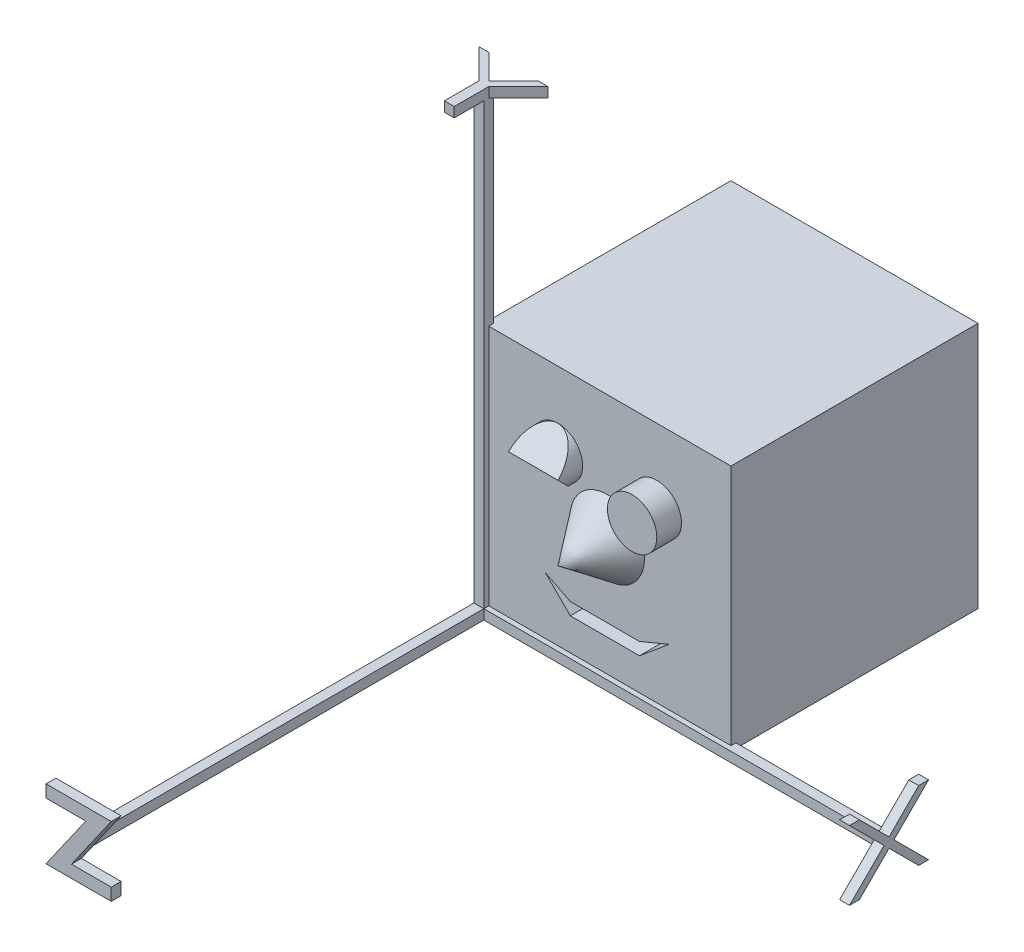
ISO-10303-21;
HEADER;
FILE_DESCRIPTION(('STEP AP214'),'2;1');
FILE_NAME('part.step','',(''),(''),'','','');
FILE_SCHEMA(('AUTOMOTIVE_DESIGN { 1 0 10303 214 1 1 1 1 }'));
ENDSEC;
DATA;
#1=APPLICATION_CONTEXT('core data for automotive mechanical design processes');
#2=APPLICATION_PROTOCOL_DEFINITION('international standard','automotive_design',2000,#1);
#3=PRODUCT_CONTEXT('',#1,'mechanical');
#4=PRODUCT('Part','Part','',(#3));
#5=PRODUCT_RELATED_PRODUCT_CATEGORY('part','',(#4));
#6=PRODUCT_DEFINITION_FORMATION('','',#4);
#7=PRODUCT_DEFINITION_CONTEXT('part definition',#1,'design');
#8=PRODUCT_DEFINITION('design','',#6,#7);
#9=PRODUCT_DEFINITION_SHAPE('','',#8);
#10=(LENGTH_UNIT() NAMED_UNIT(*) SI_UNIT(.MILLI.,.METRE.));
#11=(NAMED_UNIT(*) PLANE_ANGLE_UNIT() SI_UNIT($,.RADIAN.));
#12=(NAMED_UNIT(*) SI_UNIT($,.STERADIAN.) SOLID_ANGLE_UNIT());
#13=UNCERTAINTY_MEASURE_WITH_UNIT(LENGTH_MEASURE(1.E-05),#10,'distance_accuracy_value','');
#14=(GEOMETRIC_REPRESENTATION_CONTEXT(3) GLOBAL_UNCERTAINTY_ASSIGNED_CONTEXT((#13)) GLOBAL_UNIT_ASSIGNED_CONTEXT((#10,
#11,#12)) REPRESENTATION_CONTEXT('',''));
#15=CARTESIAN_POINT('',(0.,0.,0.));
#16=DIRECTION('',(0.,0.,1.));
#17=DIRECTION('',(1.,0.,0.));
#18=AXIS2_PLACEMENT_3D('',#15,#16,#17);
#19=CARTESIAN_POINT('',(0.,0.,-25.));
#20=DIRECTION('',(0.,-1.,0.));
#21=DIRECTION('',(0.,0.,-1.));
#22=AXIS2_PLACEMENT_3D('',#19,#20,#21);
#23=PLANE('',#22);
#24=DIRECTION('',(1.,0.,0.));
#25=VECTOR('',#24,1.);
#26=CARTESIAN_POINT('',(0.,0.,-0.5));
#27=LINE('',#26,#25);
#28=CARTESIAN_POINT('',(0.,0.,-0.5));
#29=VERTEX_POINT('',#28);
#30=CARTESIAN_POINT('',(25.,0.,-0.5));
#31=VERTEX_POINT('',#30);
#32=EDGE_CURVE('E518',#29,#31,#27,.T.);
#33=ORIENTED_EDGE('',*,*,#32,.F.);
#34=DIRECTION('',(0.,0.,1.));
#35=VECTOR('',#34,1.);
#36=CARTESIAN_POINT('',(0.,0.,-25.));
#37=LINE('',#36,#35);
#38=CARTESIAN_POINT('',(0.,0.,-25.));
#39=VERTEX_POINT('',#38);
#40=EDGE_CURVE('E910',#39,#29,#37,.T.);
#41=ORIENTED_EDGE('',*,*,#40,.F.);
#42=DIRECTION('',(1.,0.,0.));
#43=VECTOR('',#42,1.);
#44=CARTESIAN_POINT('',(0.,0.,-25.));
#45=LINE('',#44,#43);
#46=CARTESIAN_POINT('',(25.,0.,-25.));
#47=VERTEX_POINT('',#46);
#48=EDGE_CURVE('E901',#39,#47,#45,.T.);
#49=ORIENTED_EDGE('',*,*,#48,.T.);
#50=DIRECTION('',(0.,0.,1.));
#51=VECTOR('',#50,1.);
#52=CARTESIAN_POINT('',(25.,0.,-25.));
#53=LINE('',#52,#51);
#54=EDGE_CURVE('E917',#47,#31,#53,.T.);
#55=ORIENTED_EDGE('',*,*,#54,.T.);
#56=EDGE_LOOP('',(#33,#41,#49,#55));
#57=FACE_BOUND('',#56,.T.);
#58=ADVANCED_FACE('F31',(#57),#23,.T.);
#59=CARTESIAN_POINT('',(0.5,45.,-0.5));
#60=DIRECTION('',(1.,0.,0.));
#61=DIRECTION('',(0.,0.,-1.));
#62=AXIS2_PLACEMENT_3D('',#59,#60,#61);
#63=PLANE('',#62);
#64=DIRECTION('',(0.,0.,1.));
#65=VECTOR('',#64,1.);
#66=CARTESIAN_POINT('',(0.5,0.5,-0.5));
#67=LINE('',#66,#65);
#68=CARTESIAN_POINT('',(0.5,0.5,0.));
#69=VERTEX_POINT('',#68);
#70=CARTESIAN_POINT('',(0.5,0.5,0.5));
#71=VERTEX_POINT('',#70);
#72=EDGE_CURVE('E510',#69,#71,#67,.T.);
#73=ORIENTED_EDGE('',*,*,#72,.F.);
#74=DIRECTION('',(0.,-1.,0.));
#75=VECTOR('',#74,1.);
#76=CARTESIAN_POINT('',(0.5,25.,0.));
#77=LINE('',#76,#75);
#78=CARTESIAN_POINT('',(0.5,25.,0.));
#79=VERTEX_POINT('',#78);
#80=EDGE_CURVE('E833',#79,#69,#77,.T.);
#81=ORIENTED_EDGE('',*,*,#80,.F.);
#82=DIRECTION('',(0.,0.,-1.));
#83=VECTOR('',#82,1.);
#84=CARTESIAN_POINT('',(0.5,25.,-25.));
#85=LINE('',#84,#83);
#86=CARTESIAN_POINT('',(0.5,25.,-0.5));
#87=VERTEX_POINT('',#86);
#88=EDGE_CURVE('E831',#79,#87,#85,.T.);
#89=ORIENTED_EDGE('',*,*,#88,.T.);
#90=DIRECTION('',(0.,-1.,0.));
#91=VECTOR('',#90,1.);
#92=CARTESIAN_POINT('',(0.5,45.,-0.5));
#93=LINE('',#92,#91);
#94=CARTESIAN_POINT('',(0.5,45.,-0.5));
#95=VERTEX_POINT('',#94);
#96=EDGE_CURVE('E658',#95,#87,#93,.T.);
#97=ORIENTED_EDGE('',*,*,#96,.F.);
#98=DIRECTION('',(0.,0.,1.));
#99=VECTOR('',#98,1.);
#100=CARTESIAN_POINT('',(0.5,45.,-0.5));
#101=LINE('',#100,#99);
#102=CARTESIAN_POINT('',(0.5,45.,0.));
#103=VERTEX_POINT('',#102);
#104=EDGE_CURVE('E648',#95,#103,#101,.T.);
#105=ORIENTED_EDGE('',*,*,#104,.T.);
#106=DIRECTION('',(0.,-1.,0.));
#107=VECTOR('',#106,1.);
#108=CARTESIAN_POINT('',(0.5,46.,0.));
#109=LINE('',#108,#107);
#110=CARTESIAN_POINT('',(0.5,46.,0.));
#111=VERTEX_POINT('',#110);
#112=EDGE_CURVE('E673',#111,#103,#109,.T.);
#113=ORIENTED_EDGE('',*,*,#112,.F.);
#114=DIRECTION('',(0.,0.,-1.));
#115=VECTOR('',#114,1.);
#116=CARTESIAN_POINT('',(0.5,46.,0.));
#117=LINE('',#116,#115);
#118=CARTESIAN_POINT('',(0.5,46.,3.5));
#119=VERTEX_POINT('',#118);
#120=EDGE_CURVE('E761',#119,#111,#117,.T.);
#121=ORIENTED_EDGE('',*,*,#120,.F.);
#122=DIRECTION('',(0.,-1.,0.));
#123=VECTOR('',#122,1.);
#124=CARTESIAN_POINT('',(0.5,46.,3.5));
#125=LINE('',#124,#123);
#126=CARTESIAN_POINT('',(0.5,45.,3.5));
#127=VERTEX_POINT('',#126);
#128=EDGE_CURVE('E633',#119,#127,#125,.T.);
#129=ORIENTED_EDGE('',*,*,#128,.T.);
#130=DIRECTION('',(0.,0.,-1.));
#131=VECTOR('',#130,1.);
#132=CARTESIAN_POINT('',(0.5,45.,0.));
#133=LINE('',#132,#131);
#134=CARTESIAN_POINT('',(0.5,45.,0.5));
#135=VERTEX_POINT('',#134);
#136=EDGE_CURVE('E617',#127,#135,#133,.T.);
#137=ORIENTED_EDGE('',*,*,#136,.T.);
#138=DIRECTION('',(0.,-1.,0.));
#139=VECTOR('',#138,1.);
#140=CARTESIAN_POINT('',(0.5,45.,0.5));
#141=LINE('',#140,#139);
#142=EDGE_CURVE('E667',#135,#71,#141,.T.);
#143=ORIENTED_EDGE('',*,*,#142,.T.);
#144=EDGE_LOOP('',(#73,#81,#89,#97,#105,#113,#121,#129,#137,#143));
#145=FACE_BOUND('',#144,.T.);
#146=ADVANCED_FACE('F759',(#145),#63,.T.);
#147=DIRECTION('',(0.,0.,-1.));
#148=VECTOR('',#147,1.);
#149=CARTESIAN_POINT('',(0.,0.,-25.));
#150=LINE('',#149,#148);
#151=CARTESIAN_POINT('',(0.,0.,0.));
#152=VERTEX_POINT('',#151);
#153=EDGE_CURVE('E497',#152,#29,#150,.T.);
#154=ORIENTED_EDGE('',*,*,#153,.F.);
#155=DIRECTION('',(-1.,0.,0.));
#156=VECTOR('',#155,1.);
#157=CARTESIAN_POINT('',(0.,0.,0.));
#158=LINE('',#157,#156);
#159=CARTESIAN_POINT('',(-0.5,0.,0.));
#160=VERTEX_POINT('',#159);
#161=EDGE_CURVE('E612',#152,#160,#158,.T.);
#162=ORIENTED_EDGE('',*,*,#161,.T.);
#163=DIRECTION('',(0.,0.,-1.));
#164=VECTOR('',#163,1.);
#165=CARTESIAN_POINT('',(-0.5,0.,-0.5));
#166=LINE('',#165,#164);
#167=CARTESIAN_POINT('',(-0.5,0.,-0.5));
#168=VERTEX_POINT('',#167);
#169=EDGE_CURVE('E630',#160,#168,#166,.T.);
#170=ORIENTED_EDGE('',*,*,#169,.T.);
#171=DIRECTION('',(1.,0.,0.));
#172=VECTOR('',#171,1.);
#173=CARTESIAN_POINT('',(-0.5,0.,-0.5));
#174=LINE('',#173,#172);
#175=EDGE_CURVE('E632',#168,#29,#174,.T.);
#176=ORIENTED_EDGE('',*,*,#175,.T.);
#177=EDGE_LOOP('',(#154,#162,#170,#176));
#178=FACE_BOUND('',#177,.T.);
#179=ADVANCED_FACE('F957',(#178),#23,.T.);
#180=CARTESIAN_POINT('',(-0.5,45.,0.5));
#181=DIRECTION('',(0.,0.,1.));
#182=DIRECTION('',(1.,0.,0.));
#183=AXIS2_PLACEMENT_3D('',#180,#181,#182);
#184=PLANE('',#183);
#185=DIRECTION('',(0.,-1.,0.));
#186=VECTOR('',#185,1.);
#187=CARTESIAN_POINT('',(-0.5,45.,0.5));
#188=LINE('',#187,#186);
#189=CARTESIAN_POINT('',(-0.5,45.,0.5));
#190=VERTEX_POINT('',#189);
#191=CARTESIAN_POINT('',(-0.5,0.5,0.5));
#192=VERTEX_POINT('',#191);
#193=EDGE_CURVE('E670',#190,#192,#188,.T.);
#194=ORIENTED_EDGE('',*,*,#193,.T.);
#195=DIRECTION('',(1.,0.,0.));
#196=VECTOR('',#195,1.);
#197=CARTESIAN_POINT('',(-0.5,0.5,0.5));
#198=LINE('',#197,#196);
#199=EDGE_CURVE('E681',#192,#71,#198,.T.);
#200=ORIENTED_EDGE('',*,*,#199,.T.);
#201=ORIENTED_EDGE('',*,*,#142,.F.);
#202=DIRECTION('',(-1.,0.,0.));
#203=VECTOR('',#202,1.);
#204=CARTESIAN_POINT('',(-0.5,45.,0.5));
#205=LINE('',#204,#203);
#206=EDGE_CURVE('E651',#135,#190,#205,.T.);
#207=ORIENTED_EDGE('',*,*,#206,.T.);
#208=EDGE_LOOP('',(#194,#200,#201,#207));
#209=FACE_BOUND('',#208,.T.);
#210=ADVANCED_FACE('F718',(#209),#184,.T.);
#211=CARTESIAN_POINT('',(0.,25.,0.));
#212=DIRECTION('',(0.,0.,-1.));
#213=DIRECTION('',(-1.,0.,0.));
#214=AXIS2_PLACEMENT_3D('',#211,#212,#213);
#215=PLANE('',#214);
#216=CARTESIAN_POINT('',(12.5,12.5,0.));
#217=DIRECTION('',(0.,0.,-1.));
#218=DIRECTION('',(-1.,0.,0.));
#219=AXIS2_PLACEMENT_3D('',#216,#217,#218);
#220=CIRCLE('',#219,3.75);
#221=CARTESIAN_POINT('',(8.75,12.5,0.));
#222=VERTEX_POINT('',#221);
#223=EDGE_CURVE('E836',#222,#222,#220,.T.);
#224=ORIENTED_EDGE('',*,*,#223,.T.);
#225=EDGE_LOOP('',(#224));
#226=FACE_BOUND('',#225,.T.);
#227=DIRECTION('',(1.,0.,0.));
#228=VECTOR('',#227,1.);
#229=CARTESIAN_POINT('',(15.75,3.75,0.));
#230=LINE('',#229,#228);
#231=CARTESIAN_POINT('',(8.75,3.75,0.));
#232=VERTEX_POINT('',#231);
#233=CARTESIAN_POINT('',(15.75,3.75,0.));
#234=VERTEX_POINT('',#233);
#235=EDGE_CURVE('E841',#232,#234,#230,.T.);
#236=ORIENTED_EDGE('',*,*,#235,.F.);
#237=DIRECTION('',(0.707106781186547,-0.707106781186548,0.));
#238=VECTOR('',#237,1.);
#239=CARTESIAN_POINT('',(8.75,3.75,0.));
#240=LINE('',#239,#238);
#241=CARTESIAN_POINT('',(6.25,6.25,0.));
#242=VERTEX_POINT('',#241);
#243=EDGE_CURVE('E839',#242,#232,#240,.T.);
#244=ORIENTED_EDGE('',*,*,#243,.F.);
#245=DIRECTION('',(-0.894427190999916,0.447213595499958,0.));
#246=VECTOR('',#245,1.);
#247=CARTESIAN_POINT('',(6.25,6.25,0.));
#248=LINE('',#247,#246);
#249=CARTESIAN_POINT('',(8.75,5.,0.));
#250=VERTEX_POINT('',#249);
#251=EDGE_CURVE('E853',#250,#242,#248,.T.);
#252=ORIENTED_EDGE('',*,*,#251,.F.);
#253=DIRECTION('',(-1.,0.,0.));
#254=VECTOR('',#253,1.);
#255=CARTESIAN_POINT('',(8.75,5.,0.));
#256=LINE('',#255,#254);
#257=CARTESIAN_POINT('',(15.75,5.,0.));
#258=VERTEX_POINT('',#257);
#259=EDGE_CURVE('E850',#258,#250,#256,.T.);
#260=ORIENTED_EDGE('',*,*,#259,.F.);
#261=DIRECTION('',(-0.923076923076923,-0.384615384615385,0.));
#262=VECTOR('',#261,1.);
#263=CARTESIAN_POINT('',(15.75,5.,0.));
#264=LINE('',#263,#262);
#265=CARTESIAN_POINT('',(18.75,6.25,0.));
#266=VERTEX_POINT('',#265);
#267=EDGE_CURVE('E847',#266,#258,#264,.T.);
#268=ORIENTED_EDGE('',*,*,#267,.F.);
#269=DIRECTION('',(0.768221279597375,0.64018439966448,0.));
#270=VECTOR('',#269,1.);
#271=CARTESIAN_POINT('',(18.75,6.25,0.));
#272=LINE('',#271,#270);
#273=EDGE_CURVE('E844',#234,#266,#272,.T.);
#274=ORIENTED_EDGE('',*,*,#273,.F.);
#275=EDGE_LOOP('',(#236,#244,#252,#260,#268,#274));
#276=FACE_BOUND('',#275,.T.);
#277=ORIENTED_EDGE('',*,*,#80,.T.);
#278=DIRECTION('',(1.,0.,0.));
#279=VECTOR('',#278,1.);
#280=CARTESIAN_POINT('',(0.,0.5,0.));
#281=LINE('',#280,#279);
#282=CARTESIAN_POINT('',(25.,0.5,0.));
#283=VERTEX_POINT('',#282);
#284=EDGE_CURVE('E513',#69,#283,#281,.T.);
#285=ORIENTED_EDGE('',*,*,#284,.T.);
#286=DIRECTION('',(0.,1.,0.));
#287=VECTOR('',#286,1.);
#288=CARTESIAN_POINT('',(25.,0.,0.));
#289=LINE('',#288,#287);
#290=CARTESIAN_POINT('',(25.,25.,0.));
#291=VERTEX_POINT('',#290);
#292=EDGE_CURVE('E893',#283,#291,#289,.T.);
#293=ORIENTED_EDGE('',*,*,#292,.T.);
#294=DIRECTION('',(-1.,0.,0.));
#295=VECTOR('',#294,1.);
#296=CARTESIAN_POINT('',(0.,25.,0.));
#297=LINE('',#296,#295);
#298=EDGE_CURVE('E895',#291,#79,#297,.T.);
#299=ORIENTED_EDGE('',*,*,#298,.T.);
#300=EDGE_LOOP('',(#277,#285,#293,#299));
#301=FACE_BOUND('',#300,.T.);
#302=CARTESIAN_POINT('',(7.5,17.5,0.));
#303=DIRECTION('',(0.,0.,-1.));
#304=DIRECTION('',(-1.,0.,0.));
#305=AXIS2_PLACEMENT_3D('',#302,#303,#304);
#306=CIRCLE('',#305,2.5);
#307=CARTESIAN_POINT('',(7.5,20.,0.));
#308=VERTEX_POINT('',#307);
#309=CARTESIAN_POINT('',(7.5,15.,0.));
#310=VERTEX_POINT('',#309);
#311=EDGE_CURVE('E913',#308,#310,#306,.F.);
#312=ORIENTED_EDGE('',*,*,#311,.F.);
#313=EDGE_CURVE('E922',#310,#308,#306,.F.);
#314=ORIENTED_EDGE('',*,*,#313,.F.);
#315=EDGE_LOOP('',(#312,#314));
#316=FACE_BOUND('',#315,.T.);
#317=CARTESIAN_POINT('',(17.5,17.5,0.));
#318=DIRECTION('',(0.,0.,-1.));
#319=DIRECTION('',(-1.,0.,0.));
#320=AXIS2_PLACEMENT_3D('',#317,#318,#319);
#321=CIRCLE('',#320,2.5);
#322=CARTESIAN_POINT('',(15.,17.5,0.));
#323=VERTEX_POINT('',#322);
#324=EDGE_CURVE('E646',#323,#323,#321,.F.);
#325=ORIENTED_EDGE('',*,*,#324,.F.);
#326=EDGE_LOOP('',(#325));
#327=FACE_BOUND('',#326,.T.);
#328=ADVANCED_FACE('F970',(#226,#276,#301,#316,#327),#215,.F.);
#329=CARTESIAN_POINT('',(7.5,17.5,10.));
#330=DIRECTION('',(0.,0.,-1.));
#331=DIRECTION('',(-1.,0.,0.));
#332=AXIS2_PLACEMENT_3D('',#329,#330,#331);
#333=CYLINDRICAL_SURFACE('',#332,2.5);
#334=ORIENTED_EDGE('',*,*,#313,.T.);
#335=CARTESIAN_POINT('',(7.5,17.5,2.5));
#336=DIRECTION('',(0.,-0.707106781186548,-0.707106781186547));
#337=DIRECTION('',(0.,0.707106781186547,-0.707106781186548));
#338=AXIS2_PLACEMENT_3D('',#335,#336,#337);
#339=ELLIPSE('',#338,3.53553390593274,2.5);
#340=CARTESIAN_POINT('',(10.,17.5,2.5));
#341=VERTEX_POINT('',#340);
#342=EDGE_CURVE('E930',#308,#341,#339,.T.);
#343=ORIENTED_EDGE('',*,*,#342,.T.);
#344=CARTESIAN_POINT('',(7.5,17.5,2.5));
#345=DIRECTION('',(0.,0.707106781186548,-0.707106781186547));
#346=DIRECTION('',(0.,-0.707106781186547,-0.707106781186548));
#347=AXIS2_PLACEMENT_3D('',#344,#345,#346);
#348=ELLIPSE('',#347,3.53553390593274,2.5);
#349=EDGE_CURVE('E925',#341,#310,#348,.T.);
#350=ORIENTED_EDGE('',*,*,#349,.T.);
#351=EDGE_LOOP('',(#334,#343,#350));
#352=FACE_BOUND('',#351,.T.);
#353=ADVANCED_FACE('F942',(#352),#333,.T.);
#354=CARTESIAN_POINT('',(0.,0.,-25.));
#355=DIRECTION('',(-1.,0.,0.));
#356=DIRECTION('',(0.,0.,1.));
#357=AXIS2_PLACEMENT_3D('',#354,#355,#356);
#358=PLANE('',#357);
#359=DIRECTION('',(0.,-1.,0.));
#360=VECTOR('',#359,1.);
#361=CARTESIAN_POINT('',(0.,0.,-0.5));
#362=LINE('',#361,#360);
#363=CARTESIAN_POINT('',(0.,25.,-0.5));
#364=VERTEX_POINT('',#363);
#365=EDGE_CURVE('E720',#364,#29,#362,.T.);
#366=ORIENTED_EDGE('',*,*,#365,.F.);
#367=DIRECTION('',(0.,0.,1.));
#368=VECTOR('',#367,1.);
#369=CARTESIAN_POINT('',(0.,25.,-25.));
#370=LINE('',#369,#368);
#371=CARTESIAN_POINT('',(0.,25.,-25.));
#372=VERTEX_POINT('',#371);
#373=EDGE_CURVE('E911',#372,#364,#370,.T.);
#374=ORIENTED_EDGE('',*,*,#373,.F.);
#375=DIRECTION('',(0.,-1.,0.));
#376=VECTOR('',#375,1.);
#377=CARTESIAN_POINT('',(0.,0.,-25.));
#378=LINE('',#377,#376);
#379=EDGE_CURVE('E898',#372,#39,#378,.T.);
#380=ORIENTED_EDGE('',*,*,#379,.T.);
#381=ORIENTED_EDGE('',*,*,#40,.T.);
#382=EDGE_LOOP('',(#366,#374,#380,#381));
#383=FACE_BOUND('',#382,.T.);
#384=ADVANCED_FACE('F33',(#383),#358,.T.);
#385=CARTESIAN_POINT('',(0.,25.,-25.));
#386=DIRECTION('',(0.,1.,0.));
#387=DIRECTION('',(0.,0.,1.));
#388=AXIS2_PLACEMENT_3D('',#385,#386,#387);
#389=PLANE('',#388);
#390=ORIENTED_EDGE('',*,*,#88,.F.);
#391=ORIENTED_EDGE('',*,*,#298,.F.);
#392=DIRECTION('',(0.,0.,1.));
#393=VECTOR('',#392,1.);
#394=CARTESIAN_POINT('',(25.,25.,-25.));
#395=LINE('',#394,#393);
#396=CARTESIAN_POINT('',(25.,25.,-25.));
#397=VERTEX_POINT('',#396);
#398=EDGE_CURVE('E914',#397,#291,#395,.T.);
#399=ORIENTED_EDGE('',*,*,#398,.F.);
#400=DIRECTION('',(-1.,0.,0.));
#401=VECTOR('',#400,1.);
#402=CARTESIAN_POINT('',(0.,25.,-25.));
#403=LINE('',#402,#401);
#404=EDGE_CURVE('E907',#397,#372,#403,.T.);
#405=ORIENTED_EDGE('',*,*,#404,.T.);
#406=ORIENTED_EDGE('',*,*,#373,.T.);
#407=DIRECTION('',(-1.,0.,0.));
#408=VECTOR('',#407,1.);
#409=CARTESIAN_POINT('',(0.,25.,-0.5));
#410=LINE('',#409,#408);
#411=EDGE_CURVE('E54',#87,#364,#410,.T.);
#412=ORIENTED_EDGE('',*,*,#411,.F.);
#413=EDGE_LOOP('',(#390,#391,#399,#405,#406,#412));
#414=FACE_BOUND('',#413,.T.);
#415=ADVANCED_FACE('F985',(#414),#389,.T.);
#416=CARTESIAN_POINT('',(25.,0.,-25.));
#417=DIRECTION('',(1.,0.,0.));
#418=DIRECTION('',(0.,0.,-1.));
#419=AXIS2_PLACEMENT_3D('',#416,#417,#418);
#420=PLANE('',#419);
#421=DIRECTION('',(0.,1.,0.));
#422=VECTOR('',#421,1.);
#423=CARTESIAN_POINT('',(25.,0.,-0.5));
#424=LINE('',#423,#422);
#425=CARTESIAN_POINT('',(25.,0.5,-0.5));
#426=VERTEX_POINT('',#425);
#427=EDGE_CURVE('E11',#31,#426,#424,.T.);
#428=ORIENTED_EDGE('',*,*,#427,.F.);
#429=ORIENTED_EDGE('',*,*,#54,.F.);
#430=DIRECTION('',(0.,1.,0.));
#431=VECTOR('',#430,1.);
#432=CARTESIAN_POINT('',(25.,0.,-25.));
#433=LINE('',#432,#431);
#434=EDGE_CURVE('E904',#47,#397,#433,.T.);
#435=ORIENTED_EDGE('',*,*,#434,.T.);
#436=ORIENTED_EDGE('',*,*,#398,.T.);
#437=ORIENTED_EDGE('',*,*,#292,.F.);
#438=DIRECTION('',(0.,0.,1.));
#439=VECTOR('',#438,1.);
#440=CARTESIAN_POINT('',(25.,0.5,-25.));
#441=LINE('',#440,#439);
#442=EDGE_CURVE('E516',#426,#283,#441,.T.);
#443=ORIENTED_EDGE('',*,*,#442,.F.);
#444=EDGE_LOOP('',(#428,#429,#435,#436,#437,#443));
#445=FACE_BOUND('',#444,.T.);
#446=ADVANCED_FACE('F989',(#445),#420,.T.);
#447=CARTESIAN_POINT('',(0.,25.,-25.));
#448=DIRECTION('',(0.,0.,-1.));
#449=DIRECTION('',(-1.,0.,0.));
#450=AXIS2_PLACEMENT_3D('',#447,#448,#449);
#451=PLANE('',#450);
#452=ORIENTED_EDGE('',*,*,#379,.F.);
#453=ORIENTED_EDGE('',*,*,#404,.F.);
#454=ORIENTED_EDGE('',*,*,#434,.F.);
#455=ORIENTED_EDGE('',*,*,#48,.F.);
#456=EDGE_LOOP('',(#452,#453,#454,#455));
#457=FACE_BOUND('',#456,.T.);
#458=ADVANCED_FACE('F953',(#457),#451,.T.);
#459=CARTESIAN_POINT('',(5.,17.5,2.5));
#460=VERTEX_POINT('',#459);
#461=EDGE_CURVE('E927',#310,#460,#348,.T.);
#462=ORIENTED_EDGE('',*,*,#461,.T.);
#463=EDGE_CURVE('E928',#460,#308,#339,.T.);
#464=ORIENTED_EDGE('',*,*,#463,.T.);
#465=ORIENTED_EDGE('',*,*,#311,.T.);
#466=EDGE_LOOP('',(#462,#464,#465));
#467=FACE_BOUND('',#466,.T.);
#468=ADVANCED_FACE('F936',(#467),#333,.T.);
#469=CARTESIAN_POINT('',(25.,17.5,2.5));
#470=DIRECTION('',(0.,-0.707106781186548,-0.707106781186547));
#471=DIRECTION('',(0.,0.707106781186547,-0.707106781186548));
#472=AXIS2_PLACEMENT_3D('',#469,#470,#471);
#473=PLANE('',#472);
#474=ORIENTED_EDGE('',*,*,#463,.F.);
#475=DIRECTION('',(-1.,0.,0.));
#476=VECTOR('',#475,1.);
#477=CARTESIAN_POINT('',(25.,17.5,2.5));
#478=LINE('',#477,#476);
#479=EDGE_CURVE('E890',#341,#460,#478,.T.);
#480=ORIENTED_EDGE('',*,*,#479,.F.);
#481=ORIENTED_EDGE('',*,*,#342,.F.);
#482=EDGE_LOOP('',(#474,#480,#481));
#483=FACE_BOUND('',#482,.T.);
#484=ADVANCED_FACE('F944',(#483),#473,.F.);
#485=CARTESIAN_POINT('',(25.,15.,0.));
#486=DIRECTION('',(0.,0.707106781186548,-0.707106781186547));
#487=DIRECTION('',(0.,0.707106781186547,0.707106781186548));
#488=AXIS2_PLACEMENT_3D('',#485,#486,#487);
#489=PLANE('',#488);
#490=ORIENTED_EDGE('',*,*,#349,.F.);
#491=ORIENTED_EDGE('',*,*,#479,.T.);
#492=ORIENTED_EDGE('',*,*,#461,.F.);
#493=EDGE_LOOP('',(#490,#491,#492));
#494=FACE_BOUND('',#493,.T.);
#495=ADVANCED_FACE('F939',(#494),#489,.F.);
#496=CARTESIAN_POINT('',(17.5,17.5,2.5));
#497=DIRECTION('',(0.,0.,-1.));
#498=DIRECTION('',(-1.,0.,0.));
#499=AXIS2_PLACEMENT_3D('',#496,#497,#498);
#500=CYLINDRICAL_SURFACE('',#499,2.5);
#501=CARTESIAN_POINT('',(17.5,17.5,2.5));
#502=DIRECTION('',(0.,0.,1.));
#503=DIRECTION('',(1.,0.,0.));
#504=AXIS2_PLACEMENT_3D('',#501,#502,#503);
#505=CIRCLE('',#504,2.5);
#506=CARTESIAN_POINT('',(20.,17.5,2.5));
#507=VERTEX_POINT('',#506);
#508=EDGE_CURVE('E877',#507,#507,#505,.T.);
#509=ORIENTED_EDGE('',*,*,#508,.F.);
#510=EDGE_LOOP('',(#509));
#511=FACE_BOUND('',#510,.T.);
#512=ORIENTED_EDGE('',*,*,#324,.T.);
#513=EDGE_LOOP('',(#512));
#514=FACE_BOUND('',#513,.T.);
#515=ADVANCED_FACE('F951',(#511,#514),#500,.T.);
#516=CARTESIAN_POINT('',(17.5,17.5,2.5));
#517=DIRECTION('',(0.,0.,1.));
#518=DIRECTION('',(1.,0.,0.));
#519=AXIS2_PLACEMENT_3D('',#516,#517,#518);
#520=PLANE('',#519);
#521=ORIENTED_EDGE('',*,*,#508,.T.);
#522=EDGE_LOOP('',(#521));
#523=FACE_BOUND('',#522,.T.);
#524=ADVANCED_FACE('F1085',(#523),#520,.T.);
#525=CARTESIAN_POINT('',(8.75,3.75,-2.5));
#526=DIRECTION('',(-0.707106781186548,-0.707106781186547,0.));
#527=DIRECTION('',(0.707106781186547,-0.707106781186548,0.));
#528=AXIS2_PLACEMENT_3D('',#525,#526,#527);
#529=PLANE('',#528);
#530=ORIENTED_EDGE('',*,*,#243,.T.);
#531=DIRECTION('',(0.,0.,1.));
#532=VECTOR('',#531,1.);
#533=CARTESIAN_POINT('',(8.75,3.75,-2.5));
#534=LINE('',#533,#532);
#535=CARTESIAN_POINT('',(8.75,3.75,-2.5));
#536=VERTEX_POINT('',#535);
#537=EDGE_CURVE('E874',#536,#232,#534,.T.);
#538=ORIENTED_EDGE('',*,*,#537,.F.);
#539=DIRECTION('',(0.707106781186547,-0.707106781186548,0.));
#540=VECTOR('',#539,1.);
#541=CARTESIAN_POINT('',(8.75,3.75,-2.5));
#542=LINE('',#541,#540);
#543=CARTESIAN_POINT('',(6.25,6.25,-2.5));
#544=VERTEX_POINT('',#543);
#545=EDGE_CURVE('E856',#544,#536,#542,.T.);
#546=ORIENTED_EDGE('',*,*,#545,.F.);
#547=DIRECTION('',(0.,0.,1.));
#548=VECTOR('',#547,1.);
#549=CARTESIAN_POINT('',(6.25,6.25,-2.5));
#550=LINE('',#549,#548);
#551=EDGE_CURVE('E875',#544,#242,#550,.T.);
#552=ORIENTED_EDGE('',*,*,#551,.T.);
#553=EDGE_LOOP('',(#530,#538,#546,#552));
#554=FACE_BOUND('',#553,.T.);
#555=ADVANCED_FACE('F1067',(#554),#529,.F.);
#556=CARTESIAN_POINT('',(6.25,6.25,-2.5));
#557=DIRECTION('',(0.447213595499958,0.894427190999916,0.));
#558=DIRECTION('',(-0.894427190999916,0.447213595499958,0.));
#559=AXIS2_PLACEMENT_3D('',#556,#557,#558);
#560=PLANE('',#559);
#561=ORIENTED_EDGE('',*,*,#251,.T.);
#562=ORIENTED_EDGE('',*,*,#551,.F.);
#563=DIRECTION('',(-0.894427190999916,0.447213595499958,0.));
#564=VECTOR('',#563,1.);
#565=CARTESIAN_POINT('',(6.25,6.25,-2.5));
#566=LINE('',#565,#564);
#567=CARTESIAN_POINT('',(8.75,5.,-2.5));
#568=VERTEX_POINT('',#567);
#569=EDGE_CURVE('E871',#568,#544,#566,.T.);
#570=ORIENTED_EDGE('',*,*,#569,.F.);
#571=DIRECTION('',(0.,0.,1.));
#572=VECTOR('',#571,1.);
#573=CARTESIAN_POINT('',(8.75,5.,-2.5));
#574=LINE('',#573,#572);
#575=EDGE_CURVE('E878',#568,#250,#574,.T.);
#576=ORIENTED_EDGE('',*,*,#575,.T.);
#577=EDGE_LOOP('',(#561,#562,#570,#576));
#578=FACE_BOUND('',#577,.T.);
#579=ADVANCED_FACE('F1063',(#578),#560,.F.);
#580=CARTESIAN_POINT('',(8.75,5.,-2.5));
#581=DIRECTION('',(0.,1.,0.));
#582=DIRECTION('',(0.,0.,1.));
#583=AXIS2_PLACEMENT_3D('',#580,#581,#582);
#584=PLANE('',#583);
#585=ORIENTED_EDGE('',*,*,#259,.T.);
#586=ORIENTED_EDGE('',*,*,#575,.F.);
#587=DIRECTION('',(-1.,0.,0.));
#588=VECTOR('',#587,1.);
#589=CARTESIAN_POINT('',(8.75,5.,-2.5));
#590=LINE('',#589,#588);
#591=CARTESIAN_POINT('',(15.75,5.,-2.5));
#592=VERTEX_POINT('',#591);
#593=EDGE_CURVE('E868',#592,#568,#590,.T.);
#594=ORIENTED_EDGE('',*,*,#593,.F.);
#595=DIRECTION('',(0.,0.,1.));
#596=VECTOR('',#595,1.);
#597=CARTESIAN_POINT('',(15.75,5.,-2.5));
#598=LINE('',#597,#596);
#599=EDGE_CURVE('E880',#592,#258,#598,.T.);
#600=ORIENTED_EDGE('',*,*,#599,.T.);
#601=EDGE_LOOP('',(#585,#586,#594,#600));
#602=FACE_BOUND('',#601,.T.);
#603=ADVANCED_FACE('F1066',(#602),#584,.F.);
#604=CARTESIAN_POINT('',(15.75,5.,-2.5));
#605=DIRECTION('',(-0.384615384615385,0.923076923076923,0.));
#606=DIRECTION('',(-0.923076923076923,-0.384615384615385,0.));
#607=AXIS2_PLACEMENT_3D('',#604,#605,#606);
#608=PLANE('',#607);
#609=ORIENTED_EDGE('',*,*,#267,.T.);
#610=ORIENTED_EDGE('',*,*,#599,.F.);
#611=DIRECTION('',(-0.923076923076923,-0.384615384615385,0.));
#612=VECTOR('',#611,1.);
#613=CARTESIAN_POINT('',(15.75,5.,-2.5));
#614=LINE('',#613,#612);
#615=CARTESIAN_POINT('',(18.75,6.25,-2.5));
#616=VERTEX_POINT('',#615);
#617=EDGE_CURVE('E865',#616,#592,#614,.T.);
#618=ORIENTED_EDGE('',*,*,#617,.F.);
#619=DIRECTION('',(0.,0.,1.));
#620=VECTOR('',#619,1.);
#621=CARTESIAN_POINT('',(18.75,6.25,-2.5));
#622=LINE('',#621,#620);
#623=EDGE_CURVE('E882',#616,#266,#622,.T.);
#624=ORIENTED_EDGE('',*,*,#623,.T.);
#625=EDGE_LOOP('',(#609,#610,#618,#624));
#626=FACE_BOUND('',#625,.T.);
#627=ADVANCED_FACE('F1071',(#626),#608,.F.);
#628=CARTESIAN_POINT('',(18.75,6.25,-2.5));
#629=DIRECTION('',(0.64018439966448,-0.768221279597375,0.));
#630=DIRECTION('',(0.768221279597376,0.64018439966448,0.));
#631=AXIS2_PLACEMENT_3D('',#628,#629,#630);
#632=PLANE('',#631);
#633=ORIENTED_EDGE('',*,*,#273,.T.);
#634=ORIENTED_EDGE('',*,*,#623,.F.);
#635=DIRECTION('',(0.768221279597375,0.64018439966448,0.));
#636=VECTOR('',#635,1.);
#637=CARTESIAN_POINT('',(18.75,6.25,-2.5));
#638=LINE('',#637,#636);
#639=CARTESIAN_POINT('',(15.75,3.75,-2.5));
#640=VERTEX_POINT('',#639);
#641=EDGE_CURVE('E862',#640,#616,#638,.T.);
#642=ORIENTED_EDGE('',*,*,#641,.F.);
#643=DIRECTION('',(0.,0.,1.));
#644=VECTOR('',#643,1.);
#645=CARTESIAN_POINT('',(15.75,3.75,-2.5));
#646=LINE('',#645,#644);
#647=EDGE_CURVE('E884',#640,#234,#646,.T.);
#648=ORIENTED_EDGE('',*,*,#647,.T.);
#649=EDGE_LOOP('',(#633,#634,#642,#648));
#650=FACE_BOUND('',#649,.T.);
#651=ADVANCED_FACE('F1075',(#650),#632,.F.);
#652=CARTESIAN_POINT('',(15.75,3.75,-2.5));
#653=DIRECTION('',(0.,-1.,0.));
#654=DIRECTION('',(1.,0.,0.));
#655=AXIS2_PLACEMENT_3D('',#652,#653,#654);
#656=PLANE('',#655);
#657=ORIENTED_EDGE('',*,*,#235,.T.);
#658=ORIENTED_EDGE('',*,*,#647,.F.);
#659=DIRECTION('',(1.,0.,0.));
#660=VECTOR('',#659,1.);
#661=CARTESIAN_POINT('',(15.75,3.75,-2.5));
#662=LINE('',#661,#660);
#663=EDGE_CURVE('E859',#536,#640,#662,.T.);
#664=ORIENTED_EDGE('',*,*,#663,.F.);
#665=ORIENTED_EDGE('',*,*,#537,.T.);
#666=EDGE_LOOP('',(#657,#658,#664,#665));
#667=FACE_BOUND('',#666,.T.);
#668=ADVANCED_FACE('F1061',(#667),#656,.F.);
#669=CARTESIAN_POINT('',(11.9318181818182,0.568181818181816,-2.5));
#670=DIRECTION('',(0.,0.,1.));
#671=DIRECTION('',(1.,0.,0.));
#672=AXIS2_PLACEMENT_3D('',#669,#670,#671);
#673=PLANE('',#672);
#674=ORIENTED_EDGE('',*,*,#545,.T.);
#675=ORIENTED_EDGE('',*,*,#663,.T.);
#676=ORIENTED_EDGE('',*,*,#641,.T.);
#677=ORIENTED_EDGE('',*,*,#617,.T.);
#678=ORIENTED_EDGE('',*,*,#593,.T.);
#679=ORIENTED_EDGE('',*,*,#569,.T.);
#680=EDGE_LOOP('',(#674,#675,#676,#677,#678,#679));
#681=FACE_BOUND('',#680,.T.);
#682=ADVANCED_FACE('F1052',(#681),#673,.T.);
#683=CARTESIAN_POINT('',(12.5,12.5,0.));
#684=DIRECTION('',(0.,0.,-1.));
#685=DIRECTION('',(-1.,0.,0.));
#686=AXIS2_PLACEMENT_3D('',#683,#684,#685);
#687=CONICAL_SURFACE('',#686,3.75,0.643501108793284);
#688=CARTESIAN_POINT('',(12.5,12.5,5.));
#689=VERTEX_POINT('',#688);
#690=VERTEX_LOOP('',#689);
#691=FACE_BOUND('',#690,.T.);
#692=ORIENTED_EDGE('',*,*,#223,.F.);
#693=EDGE_LOOP('',(#692));
#694=FACE_BOUND('',#693,.T.);
#695=ADVANCED_FACE('F1046',(#691,#694),#687,.T.);
#696=DIRECTION('',(0.,-1.,0.));
#697=VECTOR('',#696,1.);
#698=CARTESIAN_POINT('',(0.5,45.,0.49999999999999));
#699=LINE('',#698,#697);
#700=CARTESIAN_POINT('',(0.5,-0.5,0.5));
#701=VERTEX_POINT('',#700);
#702=EDGE_CURVE('E508',#71,#701,#699,.T.);
#703=ORIENTED_EDGE('',*,*,#702,.F.);
#704=DIRECTION('',(0.,0.,-1.));
#705=VECTOR('',#704,1.);
#706=CARTESIAN_POINT('',(0.5,0.5,40.));
#707=LINE('',#706,#705);
#708=CARTESIAN_POINT('',(0.5,0.5,40.));
#709=VERTEX_POINT('',#708);
#710=EDGE_CURVE('E603',#709,#71,#707,.T.);
#711=ORIENTED_EDGE('',*,*,#710,.F.);
#712=DIRECTION('',(0.,1.,0.));
#713=VECTOR('',#712,1.);
#714=CARTESIAN_POINT('',(0.5,0.5,40.));
#715=LINE('',#714,#713);
#716=CARTESIAN_POINT('',(0.5,-0.5,40.));
#717=VERTEX_POINT('',#716);
#718=EDGE_CURVE('E594',#717,#709,#715,.T.);
#719=ORIENTED_EDGE('',*,*,#718,.F.);
#720=DIRECTION('',(0.,0.,-1.));
#721=VECTOR('',#720,1.);
#722=CARTESIAN_POINT('',(0.5,-0.5,40.));
#723=LINE('',#722,#721);
#724=EDGE_CURVE('E606',#717,#701,#723,.T.);
#725=ORIENTED_EDGE('',*,*,#724,.T.);
#726=EDGE_LOOP('',(#703,#711,#719,#725));
#727=FACE_BOUND('',#726,.T.);
#728=ADVANCED_FACE('F962',(#727),#63,.T.);
#729=CARTESIAN_POINT('',(-0.5,45.,-0.5));
#730=DIRECTION('',(-1.,0.,0.));
#731=DIRECTION('',(0.,0.,1.));
#732=AXIS2_PLACEMENT_3D('',#729,#730,#731);
#733=PLANE('',#732);
#734=ORIENTED_EDGE('',*,*,#169,.F.);
#735=DIRECTION('',(0.,-1.,0.));
#736=VECTOR('',#735,1.);
#737=CARTESIAN_POINT('',(-0.5,0.5,0.));
#738=LINE('',#737,#736);
#739=CARTESIAN_POINT('',(-0.5,-0.5,0.));
#740=VERTEX_POINT('',#739);
#741=EDGE_CURVE('E583',#160,#740,#738,.T.);
#742=ORIENTED_EDGE('',*,*,#741,.T.);
#743=DIRECTION('',(0.,0.,-1.));
#744=VECTOR('',#743,1.);
#745=CARTESIAN_POINT('',(-0.5,-0.5,40.));
#746=LINE('',#745,#744);
#747=CARTESIAN_POINT('',(-0.5,-0.5,40.));
#748=VERTEX_POINT('',#747);
#749=EDGE_CURVE('E609',#748,#740,#746,.T.);
#750=ORIENTED_EDGE('',*,*,#749,.F.);
#751=DIRECTION('',(0.,-1.,0.));
#752=VECTOR('',#751,1.);
#753=CARTESIAN_POINT('',(-0.5,0.5,40.));
#754=LINE('',#753,#752);
#755=CARTESIAN_POINT('',(-0.5,0.5,40.));
#756=VERTEX_POINT('',#755);
#757=EDGE_CURVE('E588',#756,#748,#754,.T.);
#758=ORIENTED_EDGE('',*,*,#757,.F.);
#759=DIRECTION('',(0.,0.,-1.));
#760=VECTOR('',#759,1.);
#761=CARTESIAN_POINT('',(-0.5,0.5,40.));
#762=LINE('',#761,#760);
#763=EDGE_CURVE('E600',#756,#192,#762,.T.);
#764=ORIENTED_EDGE('',*,*,#763,.T.);
#765=ORIENTED_EDGE('',*,*,#193,.F.);
#766=DIRECTION('',(0.,0.,1.));
#767=VECTOR('',#766,1.);
#768=CARTESIAN_POINT('',(-0.5,45.,3.5));
#769=LINE('',#768,#767);
#770=CARTESIAN_POINT('',(-0.5,45.,3.5));
#771=VERTEX_POINT('',#770);
#772=EDGE_CURVE('E627',#190,#771,#769,.T.);
#773=ORIENTED_EDGE('',*,*,#772,.T.);
#774=DIRECTION('',(0.,-1.,0.));
#775=VECTOR('',#774,1.);
#776=CARTESIAN_POINT('',(-0.5,46.,3.5));
#777=LINE('',#776,#775);
#778=CARTESIAN_POINT('',(-0.5,46.,3.5));
#779=VERTEX_POINT('',#778);
#780=EDGE_CURVE('E728',#779,#771,#777,.T.);
#781=ORIENTED_EDGE('',*,*,#780,.F.);
#782=DIRECTION('',(0.,0.,1.));
#783=VECTOR('',#782,1.);
#784=CARTESIAN_POINT('',(-0.5,46.,3.5));
#785=LINE('',#784,#783);
#786=CARTESIAN_POINT('',(-0.5,46.,0.));
#787=VERTEX_POINT('',#786);
#788=EDGE_CURVE('E736',#787,#779,#785,.T.);
#789=ORIENTED_EDGE('',*,*,#788,.F.);
#790=DIRECTION('',(0.,-1.,0.));
#791=VECTOR('',#790,1.);
#792=CARTESIAN_POINT('',(-0.5,46.,0.));
#793=LINE('',#792,#791);
#794=CARTESIAN_POINT('',(-0.5,45.,0.));
#795=VERTEX_POINT('',#794);
#796=EDGE_CURVE('E725',#787,#795,#793,.T.);
#797=ORIENTED_EDGE('',*,*,#796,.T.);
#798=DIRECTION('',(0.,0.,-1.));
#799=VECTOR('',#798,1.);
#800=CARTESIAN_POINT('',(-0.5,45.,-0.5));
#801=LINE('',#800,#799);
#802=CARTESIAN_POINT('',(-0.5,45.,-0.5));
#803=VERTEX_POINT('',#802);
#804=EDGE_CURVE('E636',#795,#803,#801,.T.);
#805=ORIENTED_EDGE('',*,*,#804,.T.);
#806=DIRECTION('',(0.,-1.,0.));
#807=VECTOR('',#806,1.);
#808=CARTESIAN_POINT('',(-0.5,45.,-0.5));
#809=LINE('',#808,#807);
#810=EDGE_CURVE('E664',#803,#168,#809,.T.);
#811=ORIENTED_EDGE('',*,*,#810,.T.);
#812=EDGE_LOOP('',(#734,#742,#750,#758,#764,#765,#773,#781,#789,#797,#805,#811));
#813=FACE_BOUND('',#812,.T.);
#814=ADVANCED_FACE('F694',(#813),#733,.T.);
#815=CARTESIAN_POINT('',(-0.5,45.,-0.5));
#816=DIRECTION('',(0.,0.,-1.));
#817=DIRECTION('',(-1.,0.,0.));
#818=AXIS2_PLACEMENT_3D('',#815,#816,#817);
#819=PLANE('',#818);
#820=ORIENTED_EDGE('',*,*,#411,.T.);
#821=ORIENTED_EDGE('',*,*,#365,.T.);
#822=ORIENTED_EDGE('',*,*,#175,.F.);
#823=ORIENTED_EDGE('',*,*,#810,.F.);
#824=DIRECTION('',(1.,0.,0.));
#825=VECTOR('',#824,1.);
#826=CARTESIAN_POINT('',(-0.5,45.,-0.5));
#827=LINE('',#826,#825);
#828=CARTESIAN_POINT('',(0.,45.,-0.5));
#829=VERTEX_POINT('',#828);
#830=EDGE_CURVE('E639',#803,#829,#827,.T.);
#831=ORIENTED_EDGE('',*,*,#830,.T.);
#832=EDGE_CURVE('E645',#829,#95,#827,.T.);
#833=ORIENTED_EDGE('',*,*,#832,.T.);
#834=ORIENTED_EDGE('',*,*,#96,.T.);
#835=EDGE_LOOP('',(#820,#821,#822,#823,#831,#833,#834));
#836=FACE_BOUND('',#835,.T.);
#837=ADVANCED_FACE('F826',(#836),#819,.T.);
#838=CARTESIAN_POINT('',(-0.5,45.,3.5));
#839=DIRECTION('',(0.,-1.,0.));
#840=DIRECTION('',(0.,0.,-1.));
#841=AXIS2_PLACEMENT_3D('',#838,#839,#840);
#842=PLANE('',#841);
#843=ORIENTED_EDGE('',*,*,#206,.F.);
#844=ORIENTED_EDGE('',*,*,#136,.F.);
#845=DIRECTION('',(1.,0.,0.));
#846=VECTOR('',#845,1.);
#847=CARTESIAN_POINT('',(0.5,45.,3.5));
#848=LINE('',#847,#846);
#849=EDGE_CURVE('E614',#771,#127,#848,.T.);
#850=ORIENTED_EDGE('',*,*,#849,.F.);
#851=ORIENTED_EDGE('',*,*,#772,.F.);
#852=EDGE_LOOP('',(#843,#844,#850,#851));
#853=FACE_BOUND('',#852,.T.);
#854=ADVANCED_FACE('F765',(#853),#842,.T.);
#855=ORIENTED_EDGE('',*,*,#804,.F.);
#856=DIRECTION('',(0.707106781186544,0.,0.707106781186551));
#857=VECTOR('',#856,1.);
#858=CARTESIAN_POINT('',(-0.5,45.,0.));
#859=LINE('',#858,#857);
#860=CARTESIAN_POINT('',(-3.49999999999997,45.,-3.));
#861=VERTEX_POINT('',#860);
#862=EDGE_CURVE('E652',#861,#795,#859,.T.);
#863=ORIENTED_EDGE('',*,*,#862,.F.);
#864=DIRECTION('',(-1.,0.,0.));
#865=VECTOR('',#864,1.);
#866=CARTESIAN_POINT('',(-3.49999999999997,45.,-3.));
#867=LINE('',#866,#865);
#868=CARTESIAN_POINT('',(-2.49999999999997,45.,-3.));
#869=VERTEX_POINT('',#868);
#870=EDGE_CURVE('E769',#869,#861,#867,.T.);
#871=ORIENTED_EDGE('',*,*,#870,.F.);
#872=DIRECTION('',(-0.707106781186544,0.,-0.707106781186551));
#873=VECTOR('',#872,1.);
#874=CARTESIAN_POINT('',(-2.49999999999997,45.,-3.));
#875=LINE('',#874,#873);
#876=EDGE_CURVE('E772',#829,#869,#875,.T.);
#877=ORIENTED_EDGE('',*,*,#876,.F.);
#878=ORIENTED_EDGE('',*,*,#830,.F.);
#879=EDGE_LOOP('',(#855,#863,#871,#877,#878));
#880=FACE_BOUND('',#879,.T.);
#881=ADVANCED_FACE('F820',(#880),#842,.T.);
#882=ORIENTED_EDGE('',*,*,#104,.F.);
#883=ORIENTED_EDGE('',*,*,#832,.F.);
#884=DIRECTION('',(-0.707106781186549,0.,0.707106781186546));
#885=VECTOR('',#884,1.);
#886=CARTESIAN_POINT('',(0.,45.,-0.5));
#887=LINE('',#886,#885);
#888=CARTESIAN_POINT('',(2.50000000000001,45.,-3.));
#889=VERTEX_POINT('',#888);
#890=EDGE_CURVE('E777',#889,#829,#887,.T.);
#891=ORIENTED_EDGE('',*,*,#890,.F.);
#892=DIRECTION('',(-1.,0.,0.));
#893=VECTOR('',#892,1.);
#894=CARTESIAN_POINT('',(2.50000000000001,45.,-3.));
#895=LINE('',#894,#893);
#896=CARTESIAN_POINT('',(3.50000000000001,45.,-3.));
#897=VERTEX_POINT('',#896);
#898=EDGE_CURVE('E620',#897,#889,#895,.T.);
#899=ORIENTED_EDGE('',*,*,#898,.F.);
#900=DIRECTION('',(0.707106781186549,0.,-0.707106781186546));
#901=VECTOR('',#900,1.);
#902=CARTESIAN_POINT('',(3.50000000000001,45.,-3.));
#903=LINE('',#902,#901);
#904=EDGE_CURVE('E626',#103,#897,#903,.T.);
#905=ORIENTED_EDGE('',*,*,#904,.F.);
#906=EDGE_LOOP('',(#882,#883,#891,#899,#905));
#907=FACE_BOUND('',#906,.T.);
#908=ADVANCED_FACE('F1213',(#907),#842,.T.);
#909=CARTESIAN_POINT('',(0.5,46.,3.5));
#910=DIRECTION('',(0.,0.,-1.));
#911=DIRECTION('',(-1.,0.,0.));
#912=AXIS2_PLACEMENT_3D('',#909,#910,#911);
#913=PLANE('',#912);
#914=ORIENTED_EDGE('',*,*,#849,.T.);
#915=ORIENTED_EDGE('',*,*,#128,.F.);
#916=DIRECTION('',(1.,0.,0.));
#917=VECTOR('',#916,1.);
#918=CARTESIAN_POINT('',(0.5,46.,3.5));
#919=LINE('',#918,#917);
#920=EDGE_CURVE('E766',#779,#119,#919,.T.);
#921=ORIENTED_EDGE('',*,*,#920,.F.);
#922=ORIENTED_EDGE('',*,*,#780,.T.);
#923=EDGE_LOOP('',(#914,#915,#921,#922));
#924=FACE_BOUND('',#923,.T.);
#925=ADVANCED_FACE('F763',(#924),#913,.F.);
#926=CARTESIAN_POINT('',(3.50000000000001,46.,-3.));
#927=DIRECTION('',(-0.707106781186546,0.,-0.707106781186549));
#928=DIRECTION('',(-0.707106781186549,0.,0.707106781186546));
#929=AXIS2_PLACEMENT_3D('',#926,#927,#928);
#930=PLANE('',#929);
#931=ORIENTED_EDGE('',*,*,#904,.T.);
#932=DIRECTION('',(0.,-1.,0.));
#933=VECTOR('',#932,1.);
#934=CARTESIAN_POINT('',(3.50000000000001,46.,-3.));
#935=LINE('',#934,#933);
#936=CARTESIAN_POINT('',(3.50000000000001,46.,-3.));
#937=VERTEX_POINT('',#936);
#938=EDGE_CURVE('E675',#937,#897,#935,.T.);
#939=ORIENTED_EDGE('',*,*,#938,.F.);
#940=DIRECTION('',(0.707106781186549,0.,-0.707106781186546));
#941=VECTOR('',#940,1.);
#942=CARTESIAN_POINT('',(3.50000000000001,46.,-3.));
#943=LINE('',#942,#941);
#944=EDGE_CURVE('E782',#111,#937,#943,.T.);
#945=ORIENTED_EDGE('',*,*,#944,.F.);
#946=ORIENTED_EDGE('',*,*,#112,.T.);
#947=EDGE_LOOP('',(#931,#939,#945,#946));
#948=FACE_BOUND('',#947,.T.);
#949=ADVANCED_FACE('F801',(#948),#930,.F.);
#950=CARTESIAN_POINT('',(2.50000000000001,46.,-3.));
#951=DIRECTION('',(0.,0.,1.));
#952=DIRECTION('',(1.,0.,0.));
#953=AXIS2_PLACEMENT_3D('',#950,#951,#952);
#954=PLANE('',#953);
#955=ORIENTED_EDGE('',*,*,#898,.T.);
#956=DIRECTION('',(0.,-1.,0.));
#957=VECTOR('',#956,1.);
#958=CARTESIAN_POINT('',(2.50000000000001,46.,-3.));
#959=LINE('',#958,#957);
#960=CARTESIAN_POINT('',(2.50000000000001,46.,-3.));
#961=VERTEX_POINT('',#960);
#962=EDGE_CURVE('E751',#961,#889,#959,.T.);
#963=ORIENTED_EDGE('',*,*,#962,.F.);
#964=DIRECTION('',(-1.,0.,0.));
#965=VECTOR('',#964,1.);
#966=CARTESIAN_POINT('',(2.50000000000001,46.,-3.));
#967=LINE('',#966,#965);
#968=EDGE_CURVE('E784',#937,#961,#967,.T.);
#969=ORIENTED_EDGE('',*,*,#968,.F.);
#970=ORIENTED_EDGE('',*,*,#938,.T.);
#971=EDGE_LOOP('',(#955,#963,#969,#970));
#972=FACE_BOUND('',#971,.T.);
#973=ADVANCED_FACE('F806',(#972),#954,.F.);
#974=CARTESIAN_POINT('',(0.,46.,-0.5));
#975=DIRECTION('',(0.707106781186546,0.,0.707106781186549));
#976=DIRECTION('',(0.707106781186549,0.,-0.707106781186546));
#977=AXIS2_PLACEMENT_3D('',#974,#975,#976);
#978=PLANE('',#977);
#979=ORIENTED_EDGE('',*,*,#890,.T.);
#980=DIRECTION('',(0.,-1.,0.));
#981=VECTOR('',#980,1.);
#982=CARTESIAN_POINT('',(0.,46.,-0.5));
#983=LINE('',#982,#981);
#984=CARTESIAN_POINT('',(0.,46.,-0.5));
#985=VERTEX_POINT('',#984);
#986=EDGE_CURVE('E748',#985,#829,#983,.T.);
#987=ORIENTED_EDGE('',*,*,#986,.F.);
#988=DIRECTION('',(-0.707106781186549,0.,0.707106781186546));
#989=VECTOR('',#988,1.);
#990=CARTESIAN_POINT('',(0.,46.,-0.5));
#991=LINE('',#990,#989);
#992=EDGE_CURVE('E786',#961,#985,#991,.T.);
#993=ORIENTED_EDGE('',*,*,#992,.F.);
#994=ORIENTED_EDGE('',*,*,#962,.T.);
#995=EDGE_LOOP('',(#979,#987,#993,#994));
#996=FACE_BOUND('',#995,.T.);
#997=ADVANCED_FACE('F813',(#996),#978,.F.);
#998=CARTESIAN_POINT('',(-2.49999999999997,46.,-3.));
#999=DIRECTION('',(-0.707106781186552,0.,0.707106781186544));
#1000=DIRECTION('',(0.707106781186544,0.,0.707106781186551));
#1001=AXIS2_PLACEMENT_3D('',#998,#999,#1000);
#1002=PLANE('',#1001);
#1003=ORIENTED_EDGE('',*,*,#876,.T.);
#1004=DIRECTION('',(0.,-1.,0.));
#1005=VECTOR('',#1004,1.);
#1006=CARTESIAN_POINT('',(-2.49999999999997,46.,-3.));
#1007=LINE('',#1006,#1005);
#1008=CARTESIAN_POINT('',(-2.49999999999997,46.,-3.));
#1009=VERTEX_POINT('',#1008);
#1010=EDGE_CURVE('E733',#1009,#869,#1007,.T.);
#1011=ORIENTED_EDGE('',*,*,#1010,.F.);
#1012=DIRECTION('',(-0.707106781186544,0.,-0.707106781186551));
#1013=VECTOR('',#1012,1.);
#1014=CARTESIAN_POINT('',(-2.49999999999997,46.,-3.));
#1015=LINE('',#1014,#1013);
#1016=EDGE_CURVE('E788',#985,#1009,#1015,.T.);
#1017=ORIENTED_EDGE('',*,*,#1016,.F.);
#1018=ORIENTED_EDGE('',*,*,#986,.T.);
#1019=EDGE_LOOP('',(#1003,#1011,#1017,#1018));
#1020=FACE_BOUND('',#1019,.T.);
#1021=ADVANCED_FACE('F817',(#1020),#1002,.F.);
#1022=CARTESIAN_POINT('',(-3.49999999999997,46.,-3.));
#1023=DIRECTION('',(0.,0.,1.));
#1024=DIRECTION('',(1.,0.,0.));
#1025=AXIS2_PLACEMENT_3D('',#1022,#1023,#1024);
#1026=PLANE('',#1025);
#1027=ORIENTED_EDGE('',*,*,#870,.T.);
#1028=DIRECTION('',(0.,-1.,0.));
#1029=VECTOR('',#1028,1.);
#1030=CARTESIAN_POINT('',(-3.49999999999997,46.,-3.));
#1031=LINE('',#1030,#1029);
#1032=CARTESIAN_POINT('',(-3.49999999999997,46.,-3.));
#1033=VERTEX_POINT('',#1032);
#1034=EDGE_CURVE('E727',#1033,#861,#1031,.T.);
#1035=ORIENTED_EDGE('',*,*,#1034,.F.);
#1036=DIRECTION('',(-1.,0.,0.));
#1037=VECTOR('',#1036,1.);
#1038=CARTESIAN_POINT('',(-3.49999999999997,46.,-3.));
#1039=LINE('',#1038,#1037);
#1040=EDGE_CURVE('E790',#1009,#1033,#1039,.T.);
#1041=ORIENTED_EDGE('',*,*,#1040,.F.);
#1042=ORIENTED_EDGE('',*,*,#1010,.T.);
#1043=EDGE_LOOP('',(#1027,#1035,#1041,#1042));
#1044=FACE_BOUND('',#1043,.T.);
#1045=ADVANCED_FACE('F818',(#1044),#1026,.F.);
#1046=CARTESIAN_POINT('',(-0.5,46.,0.));
#1047=DIRECTION('',(0.707106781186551,0.,-0.707106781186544));
#1048=DIRECTION('',(-0.707106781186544,0.,-0.707106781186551));
#1049=AXIS2_PLACEMENT_3D('',#1046,#1047,#1048);
#1050=PLANE('',#1049);
#1051=ORIENTED_EDGE('',*,*,#862,.T.);
#1052=ORIENTED_EDGE('',*,*,#796,.F.);
#1053=DIRECTION('',(0.707106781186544,0.,0.707106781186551));
#1054=VECTOR('',#1053,1.);
#1055=CARTESIAN_POINT('',(-0.5,46.,0.));
#1056=LINE('',#1055,#1054);
#1057=EDGE_CURVE('E742',#1033,#787,#1056,.T.);
#1058=ORIENTED_EDGE('',*,*,#1057,.F.);
#1059=ORIENTED_EDGE('',*,*,#1034,.T.);
#1060=EDGE_LOOP('',(#1051,#1052,#1058,#1059));
#1061=FACE_BOUND('',#1060,.T.);
#1062=ADVANCED_FACE('F795',(#1061),#1050,.F.);
#1063=CARTESIAN_POINT('',(-0.5,46.,3.5));
#1064=DIRECTION('',(0.,-1.,0.));
#1065=DIRECTION('',(0.,0.,-1.));
#1066=AXIS2_PLACEMENT_3D('',#1063,#1064,#1065);
#1067=PLANE('',#1066);
#1068=ORIENTED_EDGE('',*,*,#920,.T.);
#1069=ORIENTED_EDGE('',*,*,#120,.T.);
#1070=ORIENTED_EDGE('',*,*,#944,.T.);
#1071=ORIENTED_EDGE('',*,*,#968,.T.);
#1072=ORIENTED_EDGE('',*,*,#992,.T.);
#1073=ORIENTED_EDGE('',*,*,#1016,.T.);
#1074=ORIENTED_EDGE('',*,*,#1040,.T.);
#1075=ORIENTED_EDGE('',*,*,#1057,.T.);
#1076=ORIENTED_EDGE('',*,*,#788,.T.);
#1077=EDGE_LOOP('',(#1068,#1069,#1070,#1071,#1072,#1073,#1074,#1075,#1076));
#1078=FACE_BOUND('',#1077,.T.);
#1079=ADVANCED_FACE('F793',(#1078),#1067,.F.);
#1080=CARTESIAN_POINT('',(-0.5,-0.5,40.));
#1081=DIRECTION('',(0.,1.,0.));
#1082=DIRECTION('',(0.,0.,1.));
#1083=AXIS2_PLACEMENT_3D('',#1080,#1081,#1082);
#1084=PLANE('',#1083);
#1085=DIRECTION('',(-1.,0.,0.));
#1086=VECTOR('',#1085,1.);
#1087=CARTESIAN_POINT('',(40.,-0.5,0.5));
#1088=LINE('',#1087,#1086);
#1089=CARTESIAN_POINT('',(40.,-0.5,0.5));
#1090=VERTEX_POINT('',#1089);
#1091=EDGE_CURVE('E501',#1090,#701,#1088,.T.);
#1092=ORIENTED_EDGE('',*,*,#1091,.T.);
#1093=ORIENTED_EDGE('',*,*,#724,.F.);
#1094=DIRECTION('',(1.,0.,0.));
#1095=VECTOR('',#1094,1.);
#1096=CARTESIAN_POINT('',(-0.5,-0.5,40.));
#1097=LINE('',#1096,#1095);
#1098=EDGE_CURVE('E591',#748,#717,#1097,.T.);
#1099=ORIENTED_EDGE('',*,*,#1098,.F.);
#1100=ORIENTED_EDGE('',*,*,#749,.T.);
#1101=DIRECTION('',(1.,0.,0.));
#1102=VECTOR('',#1101,1.);
#1103=CARTESIAN_POINT('',(-0.5,-0.5,0.));
#1104=LINE('',#1103,#1102);
#1105=CARTESIAN_POINT('',(0.,-0.5,0.));
#1106=VERTEX_POINT('',#1105);
#1107=EDGE_CURVE('E585',#740,#1106,#1104,.T.);
#1108=ORIENTED_EDGE('',*,*,#1107,.T.);
#1109=DIRECTION('',(0.,0.,1.));
#1110=VECTOR('',#1109,1.);
#1111=CARTESIAN_POINT('',(0.,-0.5,-0.5));
#1112=LINE('',#1111,#1110);
#1113=CARTESIAN_POINT('',(0.,-0.5,-0.5));
#1114=VERTEX_POINT('',#1113);
#1115=EDGE_CURVE('E46',#1114,#1106,#1112,.T.);
#1116=ORIENTED_EDGE('',*,*,#1115,.F.);
#1117=DIRECTION('',(-1.,0.,0.));
#1118=VECTOR('',#1117,1.);
#1119=CARTESIAN_POINT('',(40.,-0.5,-0.5));
#1120=LINE('',#1119,#1118);
#1121=CARTESIAN_POINT('',(40.,-0.5,-0.5));
#1122=VERTEX_POINT('',#1121);
#1123=EDGE_CURVE('E493',#1122,#1114,#1120,.T.);
#1124=ORIENTED_EDGE('',*,*,#1123,.F.);
#1125=DIRECTION('',(0.,0.,1.));
#1126=VECTOR('',#1125,1.);
#1127=CARTESIAN_POINT('',(40.,-0.5,-0.5));
#1128=LINE('',#1127,#1126);
#1129=CARTESIAN_POINT('',(40.,-0.5,0.));
#1130=VERTEX_POINT('',#1129);
#1131=EDGE_CURVE('E483',#1122,#1130,#1128,.T.);
#1132=ORIENTED_EDGE('',*,*,#1131,.T.);
#1133=EDGE_CURVE('E482',#1130,#1090,#1128,.T.);
#1134=ORIENTED_EDGE('',*,*,#1133,.T.);
#1135=EDGE_LOOP('',(#1092,#1093,#1099,#1100,#1108,#1116,#1124,#1132,#1134));
#1136=FACE_BOUND('',#1135,.T.);
#1137=ADVANCED_FACE('F689',(#1136),#1084,.F.);
#1138=CARTESIAN_POINT('',(-0.5,0.5,40.));
#1139=DIRECTION('',(0.,-1.,0.));
#1140=DIRECTION('',(0.,0.,-1.));
#1141=AXIS2_PLACEMENT_3D('',#1138,#1139,#1140);
#1142=PLANE('',#1141);
#1143=ORIENTED_EDGE('',*,*,#199,.F.);
#1144=ORIENTED_EDGE('',*,*,#763,.F.);
#1145=DIRECTION('',(-1.,0.,0.));
#1146=VECTOR('',#1145,1.);
#1147=CARTESIAN_POINT('',(-0.5,0.5,40.));
#1148=LINE('',#1147,#1146);
#1149=EDGE_CURVE('E597',#709,#756,#1148,.T.);
#1150=ORIENTED_EDGE('',*,*,#1149,.F.);
#1151=ORIENTED_EDGE('',*,*,#710,.T.);
#1152=EDGE_LOOP('',(#1143,#1144,#1150,#1151));
#1153=FACE_BOUND('',#1152,.T.);
#1154=ADVANCED_FACE('F714',(#1153),#1142,.F.);
#1155=CARTESIAN_POINT('',(-0.5,-0.5,0.));
#1156=DIRECTION('',(0.,0.,1.));
#1157=DIRECTION('',(1.,0.,0.));
#1158=AXIS2_PLACEMENT_3D('',#1155,#1156,#1157);
#1159=PLANE('',#1158);
#1160=ORIENTED_EDGE('',*,*,#161,.F.);
#1161=DIRECTION('',(0.,-1.,0.));
#1162=VECTOR('',#1161,1.);
#1163=CARTESIAN_POINT('',(0.,-0.5,0.));
#1164=LINE('',#1163,#1162);
#1165=EDGE_CURVE('E39',#152,#1106,#1164,.T.);
#1166=ORIENTED_EDGE('',*,*,#1165,.T.);
#1167=ORIENTED_EDGE('',*,*,#1107,.F.);
#1168=ORIENTED_EDGE('',*,*,#741,.F.);
#1169=EDGE_LOOP('',(#1160,#1166,#1167,#1168));
#1170=FACE_BOUND('',#1169,.T.);
#1171=ADVANCED_FACE('F685',(#1170),#1159,.F.);
#1172=CARTESIAN_POINT('',(0.725363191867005,2.25,40.));
#1173=DIRECTION('',(0.,0.,1.));
#1174=DIRECTION('',(1.,0.,0.));
#1175=AXIS2_PLACEMENT_3D('',#1172,#1173,#1174);
#1176=PLANE('',#1175);
#1177=DIRECTION('',(-0.57357643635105,-0.819152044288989,0.));
#1178=VECTOR('',#1177,1.);
#1179=CARTESIAN_POINT('',(-0.5,0.5,40.));
#1180=LINE('',#1179,#1178);
#1181=CARTESIAN_POINT('',(-3.30083015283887,-3.5,40.));
#1182=VERTEX_POINT('',#1181);
#1183=EDGE_CURVE('E537',#756,#1182,#1180,.T.);
#1184=ORIENTED_EDGE('',*,*,#1183,.F.);
#1185=ORIENTED_EDGE('',*,*,#757,.T.);
#1186=ORIENTED_EDGE('',*,*,#1098,.T.);
#1187=DIRECTION('',(0.57357643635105,0.819152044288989,0.));
#1188=VECTOR('',#1187,1.);
#1189=CARTESIAN_POINT('',(3.30083015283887,3.5,40.));
#1190=LINE('',#1189,#1188);
#1191=CARTESIAN_POINT('',(-0.725363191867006,-2.25,40.));
#1192=VERTEX_POINT('',#1191);
#1193=EDGE_CURVE('E528',#1192,#717,#1190,.T.);
#1194=ORIENTED_EDGE('',*,*,#1193,.F.);
#1195=DIRECTION('',(-1.,0.,0.));
#1196=VECTOR('',#1195,1.);
#1197=CARTESIAN_POINT('',(-0.725363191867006,-2.25,40.));
#1198=LINE('',#1197,#1196);
#1199=CARTESIAN_POINT('',(3.30083015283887,-2.25,40.));
#1200=VERTEX_POINT('',#1199);
#1201=EDGE_CURVE('E524',#1200,#1192,#1198,.T.);
#1202=ORIENTED_EDGE('',*,*,#1201,.F.);
#1203=DIRECTION('',(0.,1.,0.));
#1204=VECTOR('',#1203,1.);
#1205=CARTESIAN_POINT('',(3.30083015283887,-2.25,40.));
#1206=LINE('',#1205,#1204);
#1207=CARTESIAN_POINT('',(3.30083015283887,-3.5,40.));
#1208=VERTEX_POINT('',#1207);
#1209=EDGE_CURVE('E522',#1208,#1200,#1206,.T.);
#1210=ORIENTED_EDGE('',*,*,#1209,.F.);
#1211=DIRECTION('',(1.,0.,0.));
#1212=VECTOR('',#1211,1.);
#1213=CARTESIAN_POINT('',(3.30083015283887,-3.5,40.));
#1214=LINE('',#1213,#1212);
#1215=EDGE_CURVE('E520',#1182,#1208,#1214,.T.);
#1216=ORIENTED_EDGE('',*,*,#1215,.F.);
#1217=EDGE_LOOP('',(#1184,#1185,#1186,#1194,#1202,#1210,#1216));
#1218=FACE_BOUND('',#1217,.T.);
#1219=ADVANCED_FACE('F698',(#1218),#1176,.F.);
#1220=CARTESIAN_POINT('',(3.30083015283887,3.5,40.));
#1221=VERTEX_POINT('',#1220);
#1222=EDGE_CURVE('E527',#717,#1221,#1190,.T.);
#1223=ORIENTED_EDGE('',*,*,#1222,.F.);
#1224=ORIENTED_EDGE('',*,*,#718,.T.);
#1225=ORIENTED_EDGE('',*,*,#1149,.T.);
#1226=CARTESIAN_POINT('',(0.725363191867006,2.25,40.));
#1227=VERTEX_POINT('',#1226);
#1228=EDGE_CURVE('E538',#1227,#756,#1180,.T.);
#1229=ORIENTED_EDGE('',*,*,#1228,.F.);
#1230=DIRECTION('',(1.,0.,0.));
#1231=VECTOR('',#1230,1.);
#1232=CARTESIAN_POINT('',(0.725363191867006,2.25,40.));
#1233=LINE('',#1232,#1231);
#1234=CARTESIAN_POINT('',(-3.30083015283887,2.25,40.));
#1235=VERTEX_POINT('',#1234);
#1236=EDGE_CURVE('E535',#1235,#1227,#1233,.T.);
#1237=ORIENTED_EDGE('',*,*,#1236,.F.);
#1238=DIRECTION('',(0.,-1.,0.));
#1239=VECTOR('',#1238,1.);
#1240=CARTESIAN_POINT('',(-3.30083015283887,2.25,40.));
#1241=LINE('',#1240,#1239);
#1242=CARTESIAN_POINT('',(-3.30083015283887,3.5,40.));
#1243=VERTEX_POINT('',#1242);
#1244=EDGE_CURVE('E533',#1243,#1235,#1241,.T.);
#1245=ORIENTED_EDGE('',*,*,#1244,.F.);
#1246=DIRECTION('',(-1.,0.,0.));
#1247=VECTOR('',#1246,1.);
#1248=CARTESIAN_POINT('',(-3.30083015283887,3.5,40.));
#1249=LINE('',#1248,#1247);
#1250=EDGE_CURVE('E531',#1221,#1243,#1249,.T.);
#1251=ORIENTED_EDGE('',*,*,#1250,.F.);
#1252=EDGE_LOOP('',(#1223,#1224,#1225,#1229,#1237,#1245,#1251));
#1253=FACE_BOUND('',#1252,.T.);
#1254=ADVANCED_FACE('F709',(#1253),#1176,.F.);
#1255=CARTESIAN_POINT('',(3.30083015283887,-3.5,41.));
#1256=DIRECTION('',(0.,1.,0.));
#1257=DIRECTION('',(-1.,0.,0.));
#1258=AXIS2_PLACEMENT_3D('',#1255,#1256,#1257);
#1259=PLANE('',#1258);
#1260=ORIENTED_EDGE('',*,*,#1215,.T.);
#1261=DIRECTION('',(0.,0.,-1.));
#1262=VECTOR('',#1261,1.);
#1263=CARTESIAN_POINT('',(3.30083015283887,-3.5,41.));
#1264=LINE('',#1263,#1262);
#1265=CARTESIAN_POINT('',(3.30083015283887,-3.5,41.));
#1266=VERTEX_POINT('',#1265);
#1267=EDGE_CURVE('E577',#1266,#1208,#1264,.T.);
#1268=ORIENTED_EDGE('',*,*,#1267,.F.);
#1269=DIRECTION('',(1.,0.,0.));
#1270=VECTOR('',#1269,1.);
#1271=CARTESIAN_POINT('',(3.30083015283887,-3.5,41.));
#1272=LINE('',#1271,#1270);
#1273=CARTESIAN_POINT('',(-3.30083015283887,-3.5,41.));
#1274=VERTEX_POINT('',#1273);
#1275=EDGE_CURVE('E544',#1274,#1266,#1272,.T.);
#1276=ORIENTED_EDGE('',*,*,#1275,.F.);
#1277=DIRECTION('',(0.,0.,-1.));
#1278=VECTOR('',#1277,1.);
#1279=CARTESIAN_POINT('',(-3.30083015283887,-3.5,41.));
#1280=LINE('',#1279,#1278);
#1281=EDGE_CURVE('E580',#1274,#1182,#1280,.T.);
#1282=ORIENTED_EDGE('',*,*,#1281,.T.);
#1283=EDGE_LOOP('',(#1260,#1268,#1276,#1282));
#1284=FACE_BOUND('',#1283,.T.);
#1285=ADVANCED_FACE('F1320',(#1284),#1259,.F.);
#1286=CARTESIAN_POINT('',(3.30083015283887,-2.25,41.));
#1287=DIRECTION('',(-1.,0.,0.));
#1288=DIRECTION('',(0.,-1.,0.));
#1289=AXIS2_PLACEMENT_3D('',#1286,#1287,#1288);
#1290=PLANE('',#1289);
#1291=ORIENTED_EDGE('',*,*,#1209,.T.);
#1292=DIRECTION('',(0.,0.,-1.));
#1293=VECTOR('',#1292,1.);
#1294=CARTESIAN_POINT('',(3.30083015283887,-2.25,41.));
#1295=LINE('',#1294,#1293);
#1296=CARTESIAN_POINT('',(3.30083015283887,-2.25,41.));
#1297=VERTEX_POINT('',#1296);
#1298=EDGE_CURVE('E574',#1297,#1200,#1295,.T.);
#1299=ORIENTED_EDGE('',*,*,#1298,.F.);
#1300=DIRECTION('',(0.,1.,0.));
#1301=VECTOR('',#1300,1.);
#1302=CARTESIAN_POINT('',(3.30083015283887,-2.25,41.));
#1303=LINE('',#1302,#1301);
#1304=EDGE_CURVE('E546',#1266,#1297,#1303,.T.);
#1305=ORIENTED_EDGE('',*,*,#1304,.F.);
#1306=ORIENTED_EDGE('',*,*,#1267,.T.);
#1307=EDGE_LOOP('',(#1291,#1299,#1305,#1306));
#1308=FACE_BOUND('',#1307,.T.);
#1309=ADVANCED_FACE('F1328',(#1308),#1290,.F.);
#1310=CARTESIAN_POINT('',(-0.725363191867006,-2.25,41.));
#1311=DIRECTION('',(0.,-1.,0.));
#1312=DIRECTION('',(1.,0.,0.));
#1313=AXIS2_PLACEMENT_3D('',#1310,#1311,#1312);
#1314=PLANE('',#1313);
#1315=ORIENTED_EDGE('',*,*,#1201,.T.);
#1316=DIRECTION('',(0.,0.,-1.));
#1317=VECTOR('',#1316,1.);
#1318=CARTESIAN_POINT('',(-0.725363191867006,-2.25,41.));
#1319=LINE('',#1318,#1317);
#1320=CARTESIAN_POINT('',(-0.725363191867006,-2.25,41.));
#1321=VERTEX_POINT('',#1320);
#1322=EDGE_CURVE('E571',#1321,#1192,#1319,.T.);
#1323=ORIENTED_EDGE('',*,*,#1322,.F.);
#1324=DIRECTION('',(-1.,0.,0.));
#1325=VECTOR('',#1324,1.);
#1326=CARTESIAN_POINT('',(-0.725363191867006,-2.25,41.));
#1327=LINE('',#1326,#1325);
#1328=EDGE_CURVE('E548',#1297,#1321,#1327,.T.);
#1329=ORIENTED_EDGE('',*,*,#1328,.F.);
#1330=ORIENTED_EDGE('',*,*,#1298,.T.);
#1331=EDGE_LOOP('',(#1315,#1323,#1329,#1330));
#1332=FACE_BOUND('',#1331,.T.);
#1333=ADVANCED_FACE('F1338',(#1332),#1314,.F.);
#1334=CARTESIAN_POINT('',(3.30083015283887,3.5,41.));
#1335=DIRECTION('',(-0.819152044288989,0.57357643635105,0.));
#1336=DIRECTION('',(-0.57357643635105,-0.819152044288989,0.));
#1337=AXIS2_PLACEMENT_3D('',#1334,#1335,#1336);
#1338=PLANE('',#1337);
#1339=ORIENTED_EDGE('',*,*,#1193,.T.);
#1340=ORIENTED_EDGE('',*,*,#1222,.T.);
#1341=DIRECTION('',(0.,0.,-1.));
#1342=VECTOR('',#1341,1.);
#1343=CARTESIAN_POINT('',(3.30083015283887,3.5,41.));
#1344=LINE('',#1343,#1342);
#1345=CARTESIAN_POINT('',(3.30083015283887,3.5,41.));
#1346=VERTEX_POINT('',#1345);
#1347=EDGE_CURVE('E568',#1346,#1221,#1344,.T.);
#1348=ORIENTED_EDGE('',*,*,#1347,.F.);
#1349=DIRECTION('',(0.57357643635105,0.819152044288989,0.));
#1350=VECTOR('',#1349,1.);
#1351=CARTESIAN_POINT('',(0.5,-0.5,41.));
#1352=LINE('',#1351,#1350);
#1353=EDGE_CURVE('E550',#1321,#1346,#1352,.T.);
#1354=ORIENTED_EDGE('',*,*,#1353,.F.);
#1355=ORIENTED_EDGE('',*,*,#1322,.T.);
#1356=EDGE_LOOP('',(#1339,#1340,#1348,#1354,#1355));
#1357=FACE_BOUND('',#1356,.T.);
#1358=ADVANCED_FACE('F1348',(#1357),#1338,.F.);
#1359=CARTESIAN_POINT('',(-3.30083015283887,3.5,41.));
#1360=DIRECTION('',(0.,-1.,0.));
#1361=DIRECTION('',(1.,0.,0.));
#1362=AXIS2_PLACEMENT_3D('',#1359,#1360,#1361);
#1363=PLANE('',#1362);
#1364=ORIENTED_EDGE('',*,*,#1250,.T.);
#1365=DIRECTION('',(0.,0.,-1.));
#1366=VECTOR('',#1365,1.);
#1367=CARTESIAN_POINT('',(-3.30083015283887,3.5,41.));
#1368=LINE('',#1367,#1366);
#1369=CARTESIAN_POINT('',(-3.30083015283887,3.5,41.));
#1370=VERTEX_POINT('',#1369);
#1371=EDGE_CURVE('E565',#1370,#1243,#1368,.T.);
#1372=ORIENTED_EDGE('',*,*,#1371,.F.);
#1373=DIRECTION('',(-1.,0.,0.));
#1374=VECTOR('',#1373,1.);
#1375=CARTESIAN_POINT('',(-3.30083015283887,3.5,41.));
#1376=LINE('',#1375,#1374);
#1377=EDGE_CURVE('E552',#1346,#1370,#1376,.T.);
#1378=ORIENTED_EDGE('',*,*,#1377,.F.);
#1379=ORIENTED_EDGE('',*,*,#1347,.T.);
#1380=EDGE_LOOP('',(#1364,#1372,#1378,#1379));
#1381=FACE_BOUND('',#1380,.T.);
#1382=ADVANCED_FACE('F1359',(#1381),#1363,.F.);
#1383=CARTESIAN_POINT('',(-3.30083015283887,2.25,41.));
#1384=DIRECTION('',(1.,0.,0.));
#1385=DIRECTION('',(0.,1.,0.));
#1386=AXIS2_PLACEMENT_3D('',#1383,#1384,#1385);
#1387=PLANE('',#1386);
#1388=ORIENTED_EDGE('',*,*,#1244,.T.);
#1389=DIRECTION('',(0.,0.,-1.));
#1390=VECTOR('',#1389,1.);
#1391=CARTESIAN_POINT('',(-3.30083015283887,2.25,41.));
#1392=LINE('',#1391,#1390);
#1393=CARTESIAN_POINT('',(-3.30083015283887,2.25,41.));
#1394=VERTEX_POINT('',#1393);
#1395=EDGE_CURVE('E562',#1394,#1235,#1392,.T.);
#1396=ORIENTED_EDGE('',*,*,#1395,.F.);
#1397=DIRECTION('',(0.,-1.,0.));
#1398=VECTOR('',#1397,1.);
#1399=CARTESIAN_POINT('',(-3.30083015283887,2.25,41.));
#1400=LINE('',#1399,#1398);
#1401=EDGE_CURVE('E554',#1370,#1394,#1400,.T.);
#1402=ORIENTED_EDGE('',*,*,#1401,.F.);
#1403=ORIENTED_EDGE('',*,*,#1371,.T.);
#1404=EDGE_LOOP('',(#1388,#1396,#1402,#1403));
#1405=FACE_BOUND('',#1404,.T.);
#1406=ADVANCED_FACE('F1369',(#1405),#1387,.F.);
#1407=CARTESIAN_POINT('',(0.725363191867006,2.25,41.));
#1408=DIRECTION('',(0.,1.,0.));
#1409=DIRECTION('',(0.,0.,1.));
#1410=AXIS2_PLACEMENT_3D('',#1407,#1408,#1409);
#1411=PLANE('',#1410);
#1412=ORIENTED_EDGE('',*,*,#1236,.T.);
#1413=DIRECTION('',(0.,0.,-1.));
#1414=VECTOR('',#1413,1.);
#1415=CARTESIAN_POINT('',(0.725363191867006,2.25,41.));
#1416=LINE('',#1415,#1414);
#1417=CARTESIAN_POINT('',(0.725363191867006,2.25,41.));
#1418=VERTEX_POINT('',#1417);
#1419=EDGE_CURVE('E559',#1418,#1227,#1416,.T.);
#1420=ORIENTED_EDGE('',*,*,#1419,.F.);
#1421=DIRECTION('',(1.,0.,0.));
#1422=VECTOR('',#1421,1.);
#1423=CARTESIAN_POINT('',(0.725363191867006,2.25,41.));
#1424=LINE('',#1423,#1422);
#1425=EDGE_CURVE('E556',#1394,#1418,#1424,.T.);
#1426=ORIENTED_EDGE('',*,*,#1425,.F.);
#1427=ORIENTED_EDGE('',*,*,#1395,.T.);
#1428=EDGE_LOOP('',(#1412,#1420,#1426,#1427));
#1429=FACE_BOUND('',#1428,.T.);
#1430=ADVANCED_FACE('F1379',(#1429),#1411,.F.);
#1431=CARTESIAN_POINT('',(-0.5,0.5,41.));
#1432=DIRECTION('',(0.819152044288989,-0.57357643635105,0.));
#1433=DIRECTION('',(0.57357643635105,0.819152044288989,0.));
#1434=AXIS2_PLACEMENT_3D('',#1431,#1432,#1433);
#1435=PLANE('',#1434);
#1436=ORIENTED_EDGE('',*,*,#1228,.T.);
#1437=ORIENTED_EDGE('',*,*,#1183,.T.);
#1438=ORIENTED_EDGE('',*,*,#1281,.F.);
#1439=DIRECTION('',(-0.57357643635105,-0.819152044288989,0.));
#1440=VECTOR('',#1439,1.);
#1441=CARTESIAN_POINT('',(-3.30083015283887,-3.5,41.));
#1442=LINE('',#1441,#1440);
#1443=EDGE_CURVE('E541',#1418,#1274,#1442,.T.);
#1444=ORIENTED_EDGE('',*,*,#1443,.F.);
#1445=ORIENTED_EDGE('',*,*,#1419,.T.);
#1446=EDGE_LOOP('',(#1436,#1437,#1438,#1444,#1445));
#1447=FACE_BOUND('',#1446,.T.);
#1448=ADVANCED_FACE('F705',(#1447),#1435,.F.);
#1449=CARTESIAN_POINT('',(0.725363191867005,2.25,41.));
#1450=DIRECTION('',(0.,0.,1.));
#1451=DIRECTION('',(1.,0.,0.));
#1452=AXIS2_PLACEMENT_3D('',#1449,#1450,#1451);
#1453=PLANE('',#1452);
#1454=ORIENTED_EDGE('',*,*,#1443,.T.);
#1455=ORIENTED_EDGE('',*,*,#1275,.T.);
#1456=ORIENTED_EDGE('',*,*,#1304,.T.);
#1457=ORIENTED_EDGE('',*,*,#1328,.T.);
#1458=ORIENTED_EDGE('',*,*,#1353,.T.);
#1459=ORIENTED_EDGE('',*,*,#1377,.T.);
#1460=ORIENTED_EDGE('',*,*,#1401,.T.);
#1461=ORIENTED_EDGE('',*,*,#1425,.T.);
#1462=EDGE_LOOP('',(#1454,#1455,#1456,#1457,#1458,#1459,#1460,#1461));
#1463=FACE_BOUND('',#1462,.T.);
#1464=ADVANCED_FACE('F1399',(#1463),#1453,.T.);
#1465=CARTESIAN_POINT('',(40.,0.5,-0.5));
#1466=DIRECTION('',(0.,0.,-1.));
#1467=DIRECTION('',(0.,1.,0.));
#1468=AXIS2_PLACEMENT_3D('',#1465,#1466,#1467);
#1469=PLANE('',#1468);
#1470=DIRECTION('',(0.,-1.,0.));
#1471=VECTOR('',#1470,1.);
#1472=CARTESIAN_POINT('',(0.,0.5,-0.5));
#1473=LINE('',#1472,#1471);
#1474=EDGE_CURVE('E393',#29,#1114,#1473,.T.);
#1475=ORIENTED_EDGE('',*,*,#1474,.F.);
#1476=ORIENTED_EDGE('',*,*,#32,.T.);
#1477=ORIENTED_EDGE('',*,*,#427,.T.);
#1478=DIRECTION('',(-1.,0.,0.));
#1479=VECTOR('',#1478,1.);
#1480=CARTESIAN_POINT('',(40.,0.5,-0.5));
#1481=LINE('',#1480,#1479);
#1482=CARTESIAN_POINT('',(40.,0.5,-0.5));
#1483=VERTEX_POINT('',#1482);
#1484=EDGE_CURVE('E494',#1483,#426,#1481,.T.);
#1485=ORIENTED_EDGE('',*,*,#1484,.F.);
#1486=DIRECTION('',(0.,-1.,0.));
#1487=VECTOR('',#1486,1.);
#1488=CARTESIAN_POINT('',(40.,0.5,-0.5));
#1489=LINE('',#1488,#1487);
#1490=CARTESIAN_POINT('',(40.,0.,-0.5));
#1491=VERTEX_POINT('',#1490);
#1492=EDGE_CURVE('E479',#1483,#1491,#1489,.T.);
#1493=ORIENTED_EDGE('',*,*,#1492,.T.);
#1494=EDGE_CURVE('E478',#1491,#1122,#1489,.T.);
#1495=ORIENTED_EDGE('',*,*,#1494,.T.);
#1496=ORIENTED_EDGE('',*,*,#1123,.T.);
#1497=EDGE_LOOP('',(#1475,#1476,#1477,#1485,#1493,#1495,#1496));
#1498=FACE_BOUND('',#1497,.T.);
#1499=ADVANCED_FACE('F975',(#1498),#1469,.T.);
#1500=CARTESIAN_POINT('',(40.,0.5,-0.5));
#1501=DIRECTION('',(0.,1.,0.));
#1502=DIRECTION('',(0.,0.,1.));
#1503=AXIS2_PLACEMENT_3D('',#1500,#1501,#1502);
#1504=PLANE('',#1503);
#1505=ORIENTED_EDGE('',*,*,#1484,.T.);
#1506=ORIENTED_EDGE('',*,*,#442,.T.);
#1507=ORIENTED_EDGE('',*,*,#284,.F.);
#1508=ORIENTED_EDGE('',*,*,#72,.T.);
#1509=DIRECTION('',(-1.,0.,0.));
#1510=VECTOR('',#1509,1.);
#1511=CARTESIAN_POINT('',(40.,0.5,0.5));
#1512=LINE('',#1511,#1510);
#1513=CARTESIAN_POINT('',(40.,0.5,0.5));
#1514=VERTEX_POINT('',#1513);
#1515=EDGE_CURVE('E498',#1514,#71,#1512,.T.);
#1516=ORIENTED_EDGE('',*,*,#1515,.F.);
#1517=DIRECTION('',(0.,0.,-1.));
#1518=VECTOR('',#1517,1.);
#1519=CARTESIAN_POINT('',(40.,0.5,-0.5));
#1520=LINE('',#1519,#1518);
#1521=CARTESIAN_POINT('',(40.,0.5,0.));
#1522=VERTEX_POINT('',#1521);
#1523=EDGE_CURVE('E491',#1514,#1522,#1520,.T.);
#1524=ORIENTED_EDGE('',*,*,#1523,.T.);
#1525=EDGE_CURVE('E490',#1522,#1483,#1520,.T.);
#1526=ORIENTED_EDGE('',*,*,#1525,.T.);
#1527=EDGE_LOOP('',(#1505,#1506,#1507,#1508,#1516,#1524,#1526));
#1528=FACE_BOUND('',#1527,.T.);
#1529=ADVANCED_FACE('F994',(#1528),#1504,.T.);
#1530=CARTESIAN_POINT('',(40.,0.5,0.5));
#1531=DIRECTION('',(0.,0.,1.));
#1532=DIRECTION('',(0.,-1.,0.));
#1533=AXIS2_PLACEMENT_3D('',#1530,#1531,#1532);
#1534=PLANE('',#1533);
#1535=ORIENTED_EDGE('',*,*,#1515,.T.);
#1536=ORIENTED_EDGE('',*,*,#702,.T.);
#1537=ORIENTED_EDGE('',*,*,#1091,.F.);
#1538=DIRECTION('',(0.,1.,0.));
#1539=VECTOR('',#1538,1.);
#1540=CARTESIAN_POINT('',(40.,0.5,0.5));
#1541=LINE('',#1540,#1539);
#1542=CARTESIAN_POINT('',(40.,0.,0.5));
#1543=VERTEX_POINT('',#1542);
#1544=EDGE_CURVE('E487',#1090,#1543,#1541,.T.);
#1545=ORIENTED_EDGE('',*,*,#1544,.T.);
#1546=EDGE_CURVE('E486',#1543,#1514,#1541,.T.);
#1547=ORIENTED_EDGE('',*,*,#1546,.T.);
#1548=EDGE_LOOP('',(#1535,#1536,#1537,#1545,#1547));
#1549=FACE_BOUND('',#1548,.T.);
#1550=ADVANCED_FACE('F1042',(#1549),#1534,.T.);
#1551=CARTESIAN_POINT('',(0.,-0.5,-0.5));
#1552=DIRECTION('',(-1.,0.,0.));
#1553=DIRECTION('',(0.,0.,1.));
#1554=AXIS2_PLACEMENT_3D('',#1551,#1552,#1553);
#1555=PLANE('',#1554);
#1556=ORIENTED_EDGE('',*,*,#1165,.F.);
#1557=ORIENTED_EDGE('',*,*,#153,.T.);
#1558=ORIENTED_EDGE('',*,*,#1474,.T.);
#1559=ORIENTED_EDGE('',*,*,#1115,.T.);
#1560=EDGE_LOOP('',(#1556,#1557,#1558,#1559));
#1561=FACE_BOUND('',#1560,.T.);
#1562=ADVANCED_FACE('F973',(#1561),#1555,.T.);
#1563=CARTESIAN_POINT('',(40.,0.5,0.));
#1564=DIRECTION('',(1.,0.,0.));
#1565=DIRECTION('',(0.,0.,-1.));
#1566=AXIS2_PLACEMENT_3D('',#1563,#1564,#1565);
#1567=PLANE('',#1566);
#1568=ORIENTED_EDGE('',*,*,#1523,.F.);
#1569=ORIENTED_EDGE('',*,*,#1546,.F.);
#1570=DIRECTION('',(0.,-0.707106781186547,-0.707106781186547));
#1571=VECTOR('',#1570,1.);
#1572=CARTESIAN_POINT('',(40.,0.,0.5));
#1573=LINE('',#1572,#1571);
#1574=CARTESIAN_POINT('',(40.,3.5,4.));
#1575=VERTEX_POINT('',#1574);
#1576=EDGE_CURVE('E381',#1575,#1543,#1573,.T.);
#1577=ORIENTED_EDGE('',*,*,#1576,.F.);
#1578=DIRECTION('',(0.,0.,1.));
#1579=VECTOR('',#1578,1.);
#1580=CARTESIAN_POINT('',(40.,3.5,4.));
#1581=LINE('',#1580,#1579);
#1582=CARTESIAN_POINT('',(40.,3.5,3.));
#1583=VERTEX_POINT('',#1582);
#1584=EDGE_CURVE('E374',#1583,#1575,#1581,.T.);
#1585=ORIENTED_EDGE('',*,*,#1584,.F.);
#1586=DIRECTION('',(0.,0.707106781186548,0.707106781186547));
#1587=VECTOR('',#1586,1.);
#1588=CARTESIAN_POINT('',(40.,3.5,3.));
#1589=LINE('',#1588,#1587);
#1590=EDGE_CURVE('E378',#1522,#1583,#1589,.T.);
#1591=ORIENTED_EDGE('',*,*,#1590,.F.);
#1592=EDGE_LOOP('',(#1568,#1569,#1577,#1585,#1591));
#1593=FACE_BOUND('',#1592,.T.);
#1594=ADVANCED_FACE('F376',(#1593),#1567,.F.);
#1595=ORIENTED_EDGE('',*,*,#1525,.F.);
#1596=DIRECTION('',(0.,-0.707106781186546,0.707106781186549));
#1597=VECTOR('',#1596,1.);
#1598=CARTESIAN_POINT('',(40.,0.5,0.));
#1599=LINE('',#1598,#1597);
#1600=CARTESIAN_POINT('',(40.,3.5,-3.00000000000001));
#1601=VERTEX_POINT('',#1600);
#1602=EDGE_CURVE('E421',#1601,#1522,#1599,.T.);
#1603=ORIENTED_EDGE('',*,*,#1602,.F.);
#1604=DIRECTION('',(0.,0.,1.));
#1605=VECTOR('',#1604,1.);
#1606=CARTESIAN_POINT('',(40.,3.5,-3.00000000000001));
#1607=LINE('',#1606,#1605);
#1608=CARTESIAN_POINT('',(40.,3.5,-4.00000000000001));
#1609=VERTEX_POINT('',#1608);
#1610=EDGE_CURVE('E419',#1609,#1601,#1607,.T.);
#1611=ORIENTED_EDGE('',*,*,#1610,.F.);
#1612=DIRECTION('',(0.,0.707106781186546,-0.707106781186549));
#1613=VECTOR('',#1612,1.);
#1614=CARTESIAN_POINT('',(40.,3.5,-4.00000000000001));
#1615=LINE('',#1614,#1613);
#1616=EDGE_CURVE('E417',#1491,#1609,#1615,.T.);
#1617=ORIENTED_EDGE('',*,*,#1616,.F.);
#1618=ORIENTED_EDGE('',*,*,#1492,.F.);
#1619=EDGE_LOOP('',(#1595,#1603,#1611,#1617,#1618));
#1620=FACE_BOUND('',#1619,.T.);
#1621=ADVANCED_FACE('F998',(#1620),#1567,.F.);
#1622=ORIENTED_EDGE('',*,*,#1494,.F.);
#1623=DIRECTION('',(0.,0.707106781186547,0.707106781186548));
#1624=VECTOR('',#1623,1.);
#1625=CARTESIAN_POINT('',(40.,0.,-0.5));
#1626=LINE('',#1625,#1624);
#1627=CARTESIAN_POINT('',(40.,-3.5,-4.));
#1628=VERTEX_POINT('',#1627);
#1629=EDGE_CURVE('E414',#1628,#1491,#1626,.T.);
#1630=ORIENTED_EDGE('',*,*,#1629,.F.);
#1631=DIRECTION('',(0.,0.,-1.));
#1632=VECTOR('',#1631,1.);
#1633=CARTESIAN_POINT('',(40.,-3.5,-4.));
#1634=LINE('',#1633,#1632);
#1635=CARTESIAN_POINT('',(40.,-3.5,-3.));
#1636=VERTEX_POINT('',#1635);
#1637=EDGE_CURVE('E412',#1636,#1628,#1634,.T.);
#1638=ORIENTED_EDGE('',*,*,#1637,.F.);
#1639=DIRECTION('',(0.,-0.707106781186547,-0.707106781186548));
#1640=VECTOR('',#1639,1.);
#1641=CARTESIAN_POINT('',(40.,-3.5,-3.));
#1642=LINE('',#1641,#1640);
#1643=EDGE_CURVE('E410',#1130,#1636,#1642,.T.);
#1644=ORIENTED_EDGE('',*,*,#1643,.F.);
#1645=ORIENTED_EDGE('',*,*,#1131,.F.);
#1646=EDGE_LOOP('',(#1622,#1630,#1638,#1644,#1645));
#1647=FACE_BOUND('',#1646,.T.);
#1648=ADVANCED_FACE('F1015',(#1647),#1567,.F.);
#1649=CARTESIAN_POINT('',(41.,3.5,3.));
#1650=DIRECTION('',(0.,-0.707106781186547,0.707106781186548));
#1651=DIRECTION('',(0.,-0.707106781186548,-0.707106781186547));
#1652=AXIS2_PLACEMENT_3D('',#1649,#1650,#1651);
#1653=PLANE('',#1652);
#1654=ORIENTED_EDGE('',*,*,#1590,.T.);
#1655=DIRECTION('',(-1.,0.,0.));
#1656=VECTOR('',#1655,1.);
#1657=CARTESIAN_POINT('',(41.,3.5,3.));
#1658=LINE('',#1657,#1656);
#1659=CARTESIAN_POINT('',(41.,3.5,3.));
#1660=VERTEX_POINT('',#1659);
#1661=EDGE_CURVE('E387',#1660,#1583,#1658,.T.);
#1662=ORIENTED_EDGE('',*,*,#1661,.F.);
#1663=DIRECTION('',(0.,0.707106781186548,0.707106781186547));
#1664=VECTOR('',#1663,1.);
#1665=CARTESIAN_POINT('',(41.,3.5,3.));
#1666=LINE('',#1665,#1664);
#1667=CARTESIAN_POINT('',(41.,0.5,0.));
#1668=VERTEX_POINT('',#1667);
#1669=EDGE_CURVE('E424',#1668,#1660,#1666,.T.);
#1670=ORIENTED_EDGE('',*,*,#1669,.F.);
#1671=DIRECTION('',(-1.,0.,0.));
#1672=VECTOR('',#1671,1.);
#1673=CARTESIAN_POINT('',(41.,0.5,0.));
#1674=LINE('',#1673,#1672);
#1675=EDGE_CURVE('E399',#1668,#1522,#1674,.T.);
#1676=ORIENTED_EDGE('',*,*,#1675,.T.);
#1677=EDGE_LOOP('',(#1654,#1662,#1670,#1676));
#1678=FACE_BOUND('',#1677,.T.);
#1679=ADVANCED_FACE('F397',(#1678),#1653,.F.);
#1680=CARTESIAN_POINT('',(41.,3.5,4.));
#1681=DIRECTION('',(0.,-1.,0.));
#1682=DIRECTION('',(0.,0.,-1.));
#1683=AXIS2_PLACEMENT_3D('',#1680,#1681,#1682);
#1684=PLANE('',#1683);
#1685=ORIENTED_EDGE('',*,*,#1584,.T.);
#1686=DIRECTION('',(-1.,0.,0.));
#1687=VECTOR('',#1686,1.);
#1688=CARTESIAN_POINT('',(41.,3.5,4.));
#1689=LINE('',#1688,#1687);
#1690=CARTESIAN_POINT('',(41.,3.5,4.));
#1691=VERTEX_POINT('',#1690);
#1692=EDGE_CURVE('E394',#1691,#1575,#1689,.T.);
#1693=ORIENTED_EDGE('',*,*,#1692,.F.);
#1694=DIRECTION('',(0.,0.,1.));
#1695=VECTOR('',#1694,1.);
#1696=CARTESIAN_POINT('',(41.,3.5,4.));
#1697=LINE('',#1696,#1695);
#1698=EDGE_CURVE('E389',#1660,#1691,#1697,.T.);
#1699=ORIENTED_EDGE('',*,*,#1698,.F.);
#1700=ORIENTED_EDGE('',*,*,#1661,.T.);
#1701=EDGE_LOOP('',(#1685,#1693,#1699,#1700));
#1702=FACE_BOUND('',#1701,.T.);
#1703=ADVANCED_FACE('F388',(#1702),#1684,.F.);
#1704=CARTESIAN_POINT('',(41.,0.,0.5));
#1705=DIRECTION('',(0.,0.707106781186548,-0.707106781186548));
#1706=DIRECTION('',(0.,0.707106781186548,0.707106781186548));
#1707=AXIS2_PLACEMENT_3D('',#1704,#1705,#1706);
#1708=PLANE('',#1707);
#1709=ORIENTED_EDGE('',*,*,#1576,.T.);
#1710=DIRECTION('',(-1.,0.,0.));
#1711=VECTOR('',#1710,1.);
#1712=CARTESIAN_POINT('',(41.,0.,0.5));
#1713=LINE('',#1712,#1711);
#1714=CARTESIAN_POINT('',(41.,0.,0.5));
#1715=VERTEX_POINT('',#1714);
#1716=EDGE_CURVE('E472',#1715,#1543,#1713,.T.);
#1717=ORIENTED_EDGE('',*,*,#1716,.F.);
#1718=DIRECTION('',(0.,-0.707106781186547,-0.707106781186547));
#1719=VECTOR('',#1718,1.);
#1720=CARTESIAN_POINT('',(41.,0.,0.5));
#1721=LINE('',#1720,#1719);
#1722=EDGE_CURVE('E427',#1691,#1715,#1721,.T.);
#1723=ORIENTED_EDGE('',*,*,#1722,.F.);
#1724=ORIENTED_EDGE('',*,*,#1692,.T.);
#1725=EDGE_LOOP('',(#1709,#1717,#1723,#1724));
#1726=FACE_BOUND('',#1725,.T.);
#1727=ADVANCED_FACE('F1546',(#1726),#1708,.F.);
#1728=CARTESIAN_POINT('',(41.,-3.5,4.));
#1729=DIRECTION('',(0.,-0.707106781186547,-0.707106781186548));
#1730=DIRECTION('',(0.,0.707106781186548,-0.707106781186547));
#1731=AXIS2_PLACEMENT_3D('',#1728,#1729,#1730);
#1732=PLANE('',#1731);
#1733=DIRECTION('',(0.,-0.707106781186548,0.707106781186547));
#1734=VECTOR('',#1733,1.);
#1735=CARTESIAN_POINT('',(40.,-3.5,4.));
#1736=LINE('',#1735,#1734);
#1737=CARTESIAN_POINT('',(40.,-3.5,4.));
#1738=VERTEX_POINT('',#1737);
#1739=EDGE_CURVE('E403',#1543,#1738,#1736,.T.);
#1740=ORIENTED_EDGE('',*,*,#1739,.T.);
#1741=DIRECTION('',(-1.,0.,0.));
#1742=VECTOR('',#1741,1.);
#1743=CARTESIAN_POINT('',(41.,-3.5,4.));
#1744=LINE('',#1743,#1742);
#1745=CARTESIAN_POINT('',(41.,-3.5,4.));
#1746=VERTEX_POINT('',#1745);
#1747=EDGE_CURVE('E469',#1746,#1738,#1744,.T.);
#1748=ORIENTED_EDGE('',*,*,#1747,.F.);
#1749=DIRECTION('',(0.,-0.707106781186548,0.707106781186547));
#1750=VECTOR('',#1749,1.);
#1751=CARTESIAN_POINT('',(41.,-3.5,4.));
#1752=LINE('',#1751,#1750);
#1753=EDGE_CURVE('E429',#1715,#1746,#1752,.T.);
#1754=ORIENTED_EDGE('',*,*,#1753,.F.);
#1755=ORIENTED_EDGE('',*,*,#1716,.T.);
#1756=EDGE_LOOP('',(#1740,#1748,#1754,#1755));
#1757=FACE_BOUND('',#1756,.T.);
#1758=ADVANCED_FACE('F1555',(#1757),#1732,.F.);
#1759=CARTESIAN_POINT('',(41.,-3.5,3.));
#1760=DIRECTION('',(0.,1.,0.));
#1761=DIRECTION('',(0.,0.,1.));
#1762=AXIS2_PLACEMENT_3D('',#1759,#1760,#1761);
#1763=PLANE('',#1762);
#1764=DIRECTION('',(0.,0.,-1.));
#1765=VECTOR('',#1764,1.);
#1766=CARTESIAN_POINT('',(40.,-3.5,3.));
#1767=LINE('',#1766,#1765);
#1768=CARTESIAN_POINT('',(40.,-3.5,3.));
#1769=VERTEX_POINT('',#1768);
#1770=EDGE_CURVE('E405',#1738,#1769,#1767,.T.);
#1771=ORIENTED_EDGE('',*,*,#1770,.T.);
#1772=DIRECTION('',(-1.,0.,0.));
#1773=VECTOR('',#1772,1.);
#1774=CARTESIAN_POINT('',(41.,-3.5,3.));
#1775=LINE('',#1774,#1773);
#1776=CARTESIAN_POINT('',(41.,-3.5,3.));
#1777=VERTEX_POINT('',#1776);
#1778=EDGE_CURVE('E466',#1777,#1769,#1775,.T.);
#1779=ORIENTED_EDGE('',*,*,#1778,.F.);
#1780=DIRECTION('',(0.,0.,-1.));
#1781=VECTOR('',#1780,1.);
#1782=CARTESIAN_POINT('',(41.,-3.5,3.));
#1783=LINE('',#1782,#1781);
#1784=EDGE_CURVE('E431',#1746,#1777,#1783,.T.);
#1785=ORIENTED_EDGE('',*,*,#1784,.F.);
#1786=ORIENTED_EDGE('',*,*,#1747,.T.);
#1787=EDGE_LOOP('',(#1771,#1779,#1785,#1786));
#1788=FACE_BOUND('',#1787,.T.);
#1789=ADVANCED_FACE('F1565',(#1788),#1763,.F.);
#1790=CARTESIAN_POINT('',(41.,-0.5,0.));
#1791=DIRECTION('',(0.,0.707106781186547,0.707106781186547));
#1792=DIRECTION('',(0.,-0.707106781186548,0.707106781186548));
#1793=AXIS2_PLACEMENT_3D('',#1790,#1791,#1792);
#1794=PLANE('',#1793);
#1795=DIRECTION('',(0.,0.707106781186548,-0.707106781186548));
#1796=VECTOR('',#1795,1.);
#1797=CARTESIAN_POINT('',(40.,-0.5,0.));
#1798=LINE('',#1797,#1796);
#1799=EDGE_CURVE('E407',#1769,#1130,#1798,.T.);
#1800=ORIENTED_EDGE('',*,*,#1799,.T.);
#1801=DIRECTION('',(-1.,0.,0.));
#1802=VECTOR('',#1801,1.);
#1803=CARTESIAN_POINT('',(41.,-0.5,0.));
#1804=LINE('',#1803,#1802);
#1805=CARTESIAN_POINT('',(41.,-0.5,0.));
#1806=VERTEX_POINT('',#1805);
#1807=EDGE_CURVE('E463',#1806,#1130,#1804,.T.);
#1808=ORIENTED_EDGE('',*,*,#1807,.F.);
#1809=DIRECTION('',(0.,0.707106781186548,-0.707106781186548));
#1810=VECTOR('',#1809,1.);
#1811=CARTESIAN_POINT('',(41.,-0.5,0.));
#1812=LINE('',#1811,#1810);
#1813=EDGE_CURVE('E433',#1777,#1806,#1812,.T.);
#1814=ORIENTED_EDGE('',*,*,#1813,.F.);
#1815=ORIENTED_EDGE('',*,*,#1778,.T.);
#1816=EDGE_LOOP('',(#1800,#1808,#1814,#1815));
#1817=FACE_BOUND('',#1816,.T.);
#1818=ADVANCED_FACE('F1034',(#1817),#1794,.F.);
#1819=CARTESIAN_POINT('',(41.,-3.5,-3.));
#1820=DIRECTION('',(0.,0.707106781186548,-0.707106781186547));
#1821=DIRECTION('',(0.,0.707106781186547,0.707106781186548));
#1822=AXIS2_PLACEMENT_3D('',#1819,#1820,#1821);
#1823=PLANE('',#1822);
#1824=ORIENTED_EDGE('',*,*,#1643,.T.);
#1825=DIRECTION('',(-1.,0.,0.));
#1826=VECTOR('',#1825,1.);
#1827=CARTESIAN_POINT('',(41.,-3.5,-3.));
#1828=LINE('',#1827,#1826);
#1829=CARTESIAN_POINT('',(41.,-3.5,-3.));
#1830=VERTEX_POINT('',#1829);
#1831=EDGE_CURVE('E460',#1830,#1636,#1828,.T.);
#1832=ORIENTED_EDGE('',*,*,#1831,.F.);
#1833=DIRECTION('',(0.,-0.707106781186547,-0.707106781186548));
#1834=VECTOR('',#1833,1.);
#1835=CARTESIAN_POINT('',(41.,-3.5,-3.));
#1836=LINE('',#1835,#1834);
#1837=EDGE_CURVE('E435',#1806,#1830,#1836,.T.);
#1838=ORIENTED_EDGE('',*,*,#1837,.F.);
#1839=ORIENTED_EDGE('',*,*,#1807,.T.);
#1840=EDGE_LOOP('',(#1824,#1832,#1838,#1839));
#1841=FACE_BOUND('',#1840,.T.);
#1842=ADVANCED_FACE('F1019',(#1841),#1823,.F.);
#1843=CARTESIAN_POINT('',(41.,-3.5,-4.));
#1844=DIRECTION('',(0.,1.,0.));
#1845=DIRECTION('',(0.,0.,1.));
#1846=AXIS2_PLACEMENT_3D('',#1843,#1844,#1845);
#1847=PLANE('',#1846);
#1848=ORIENTED_EDGE('',*,*,#1637,.T.);
#1849=DIRECTION('',(-1.,0.,0.));
#1850=VECTOR('',#1849,1.);
#1851=CARTESIAN_POINT('',(41.,-3.5,-4.));
#1852=LINE('',#1851,#1850);
#1853=CARTESIAN_POINT('',(41.,-3.5,-4.));
#1854=VERTEX_POINT('',#1853);
#1855=EDGE_CURVE('E457',#1854,#1628,#1852,.T.);
#1856=ORIENTED_EDGE('',*,*,#1855,.F.);
#1857=DIRECTION('',(0.,0.,-1.));
#1858=VECTOR('',#1857,1.);
#1859=CARTESIAN_POINT('',(41.,-3.5,-4.));
#1860=LINE('',#1859,#1858);
#1861=EDGE_CURVE('E437',#1830,#1854,#1860,.T.);
#1862=ORIENTED_EDGE('',*,*,#1861,.F.);
#1863=ORIENTED_EDGE('',*,*,#1831,.T.);
#1864=EDGE_LOOP('',(#1848,#1856,#1862,#1863));
#1865=FACE_BOUND('',#1864,.T.);
#1866=ADVANCED_FACE('F1024',(#1865),#1847,.F.);
#1867=CARTESIAN_POINT('',(41.,0.,-0.5));
#1868=DIRECTION('',(0.,-0.707106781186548,0.707106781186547));
#1869=DIRECTION('',(0.,-0.707106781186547,-0.707106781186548));
#1870=AXIS2_PLACEMENT_3D('',#1867,#1868,#1869);
#1871=PLANE('',#1870);
#1872=ORIENTED_EDGE('',*,*,#1629,.T.);
#1873=DIRECTION('',(-1.,0.,0.));
#1874=VECTOR('',#1873,1.);
#1875=CARTESIAN_POINT('',(41.,0.,-0.5));
#1876=LINE('',#1875,#1874);
#1877=CARTESIAN_POINT('',(41.,0.,-0.5));
#1878=VERTEX_POINT('',#1877);
#1879=EDGE_CURVE('E454',#1878,#1491,#1876,.T.);
#1880=ORIENTED_EDGE('',*,*,#1879,.F.);
#1881=DIRECTION('',(0.,0.707106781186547,0.707106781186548));
#1882=VECTOR('',#1881,1.);
#1883=CARTESIAN_POINT('',(41.,0.,-0.5));
#1884=LINE('',#1883,#1882);
#1885=EDGE_CURVE('E439',#1854,#1878,#1884,.T.);
#1886=ORIENTED_EDGE('',*,*,#1885,.F.);
#1887=ORIENTED_EDGE('',*,*,#1855,.T.);
#1888=EDGE_LOOP('',(#1872,#1880,#1886,#1887));
#1889=FACE_BOUND('',#1888,.T.);
#1890=ADVANCED_FACE('F1600',(#1889),#1871,.F.);
#1891=CARTESIAN_POINT('',(41.,3.5,-4.00000000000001));
#1892=DIRECTION('',(0.,0.707106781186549,0.707106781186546));
#1893=DIRECTION('',(0.,-0.707106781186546,0.707106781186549));
#1894=AXIS2_PLACEMENT_3D('',#1891,#1892,#1893);
#1895=PLANE('',#1894);
#1896=ORIENTED_EDGE('',*,*,#1616,.T.);
#1897=DIRECTION('',(-1.,0.,0.));
#1898=VECTOR('',#1897,1.);
#1899=CARTESIAN_POINT('',(41.,3.5,-4.00000000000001));
#1900=LINE('',#1899,#1898);
#1901=CARTESIAN_POINT('',(41.,3.5,-4.00000000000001));
#1902=VERTEX_POINT('',#1901);
#1903=EDGE_CURVE('E451',#1902,#1609,#1900,.T.);
#1904=ORIENTED_EDGE('',*,*,#1903,.F.);
#1905=DIRECTION('',(0.,0.707106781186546,-0.707106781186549));
#1906=VECTOR('',#1905,1.);
#1907=CARTESIAN_POINT('',(41.,3.5,-4.00000000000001));
#1908=LINE('',#1907,#1906);
#1909=EDGE_CURVE('E441',#1878,#1902,#1908,.T.);
#1910=ORIENTED_EDGE('',*,*,#1909,.F.);
#1911=ORIENTED_EDGE('',*,*,#1879,.T.);
#1912=EDGE_LOOP('',(#1896,#1904,#1910,#1911));
#1913=FACE_BOUND('',#1912,.T.);
#1914=ADVANCED_FACE('F1609',(#1913),#1895,.F.);
#1915=CARTESIAN_POINT('',(41.,3.5,-3.00000000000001));
#1916=DIRECTION('',(0.,-1.,0.));
#1917=DIRECTION('',(0.,0.,-1.));
#1918=AXIS2_PLACEMENT_3D('',#1915,#1916,#1917);
#1919=PLANE('',#1918);
#1920=ORIENTED_EDGE('',*,*,#1610,.T.);
#1921=DIRECTION('',(-1.,0.,0.));
#1922=VECTOR('',#1921,1.);
#1923=CARTESIAN_POINT('',(41.,3.5,-3.00000000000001));
#1924=LINE('',#1923,#1922);
#1925=CARTESIAN_POINT('',(41.,3.5,-3.00000000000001));
#1926=VERTEX_POINT('',#1925);
#1927=EDGE_CURVE('E448',#1926,#1601,#1924,.T.);
#1928=ORIENTED_EDGE('',*,*,#1927,.F.);
#1929=DIRECTION('',(0.,0.,1.));
#1930=VECTOR('',#1929,1.);
#1931=CARTESIAN_POINT('',(41.,3.5,-3.00000000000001));
#1932=LINE('',#1931,#1930);
#1933=EDGE_CURVE('E443',#1902,#1926,#1932,.T.);
#1934=ORIENTED_EDGE('',*,*,#1933,.F.);
#1935=ORIENTED_EDGE('',*,*,#1903,.T.);
#1936=EDGE_LOOP('',(#1920,#1928,#1934,#1935));
#1937=FACE_BOUND('',#1936,.T.);
#1938=ADVANCED_FACE('F1007',(#1937),#1919,.F.);
#1939=CARTESIAN_POINT('',(41.,0.5,0.));
#1940=DIRECTION('',(0.,-0.707106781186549,-0.707106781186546));
#1941=DIRECTION('',(0.,0.707106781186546,-0.707106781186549));
#1942=AXIS2_PLACEMENT_3D('',#1939,#1940,#1941);
#1943=PLANE('',#1942);
#1944=ORIENTED_EDGE('',*,*,#1602,.T.);
#1945=ORIENTED_EDGE('',*,*,#1675,.F.);
#1946=DIRECTION('',(0.,-0.707106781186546,0.707106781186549));
#1947=VECTOR('',#1946,1.);
#1948=CARTESIAN_POINT('',(41.,0.5,0.));
#1949=LINE('',#1948,#1947);
#1950=EDGE_CURVE('E445',#1926,#1668,#1949,.T.);
#1951=ORIENTED_EDGE('',*,*,#1950,.F.);
#1952=ORIENTED_EDGE('',*,*,#1927,.T.);
#1953=EDGE_LOOP('',(#1944,#1945,#1951,#1952));
#1954=FACE_BOUND('',#1953,.T.);
#1955=ADVANCED_FACE('F1002',(#1954),#1943,.F.);
#1956=CARTESIAN_POINT('',(41.,0.5,0.));
#1957=DIRECTION('',(1.,0.,0.));
#1958=DIRECTION('',(0.,0.,-1.));
#1959=AXIS2_PLACEMENT_3D('',#1956,#1957,#1958);
#1960=PLANE('',#1959);
#1961=ORIENTED_EDGE('',*,*,#1669,.T.);
#1962=ORIENTED_EDGE('',*,*,#1698,.T.);
#1963=ORIENTED_EDGE('',*,*,#1722,.T.);
#1964=ORIENTED_EDGE('',*,*,#1753,.T.);
#1965=ORIENTED_EDGE('',*,*,#1784,.T.);
#1966=ORIENTED_EDGE('',*,*,#1813,.T.);
#1967=ORIENTED_EDGE('',*,*,#1837,.T.);
#1968=ORIENTED_EDGE('',*,*,#1861,.T.);
#1969=ORIENTED_EDGE('',*,*,#1885,.T.);
#1970=ORIENTED_EDGE('',*,*,#1909,.T.);
#1971=ORIENTED_EDGE('',*,*,#1933,.T.);
#1972=ORIENTED_EDGE('',*,*,#1950,.T.);
#1973=EDGE_LOOP('',(#1961,#1962,#1963,#1964,#1965,#1966,#1967,#1968,#1969,#1970,#1971,#1972));
#1974=FACE_BOUND('',#1973,.T.);
#1975=ADVANCED_FACE('F1028',(#1974),#1960,.T.);
#1976=ORIENTED_EDGE('',*,*,#1544,.F.);
#1977=ORIENTED_EDGE('',*,*,#1133,.F.);
#1978=ORIENTED_EDGE('',*,*,#1799,.F.);
#1979=ORIENTED_EDGE('',*,*,#1770,.F.);
#1980=ORIENTED_EDGE('',*,*,#1739,.F.);
#1981=EDGE_LOOP('',(#1976,#1977,#1978,#1979,#1980));
#1982=FACE_BOUND('',#1981,.T.);
#1983=ADVANCED_FACE('F1038',(#1982),#1567,.F.);
#1984=CLOSED_SHELL('',(#58,#146,#179,#210,#328,#353,#384,#415,#446,#458,#468,#484,#495,#515,
#524,#555,#579,#603,#627,#651,#668,#682,#695,#728,#814,#837,#854,#881,#908,#925,#949,#973,#997,
#1021,#1045,#1062,#1079,#1137,#1154,#1171,#1219,#1254,#1285,#1309,#1333,#1358,#1382,#1406,#1430,
#1448,#1464,#1499,#1529,#1550,#1562,#1594,#1621,#1648,#1679,#1703,#1727,#1758,#1789,#1818,#1842,
#1866,#1890,#1914,#1938,#1955,#1975,#1983));
#1985=MANIFOLD_SOLID_BREP('B2',#1984);
#1986=ADVANCED_BREP_SHAPE_REPRESENTATION('',(#18,#1985),#14);
#1987=SHAPE_DEFINITION_REPRESENTATION(#9,#1986);
ENDSEC;
END-ISO-10303-21;
